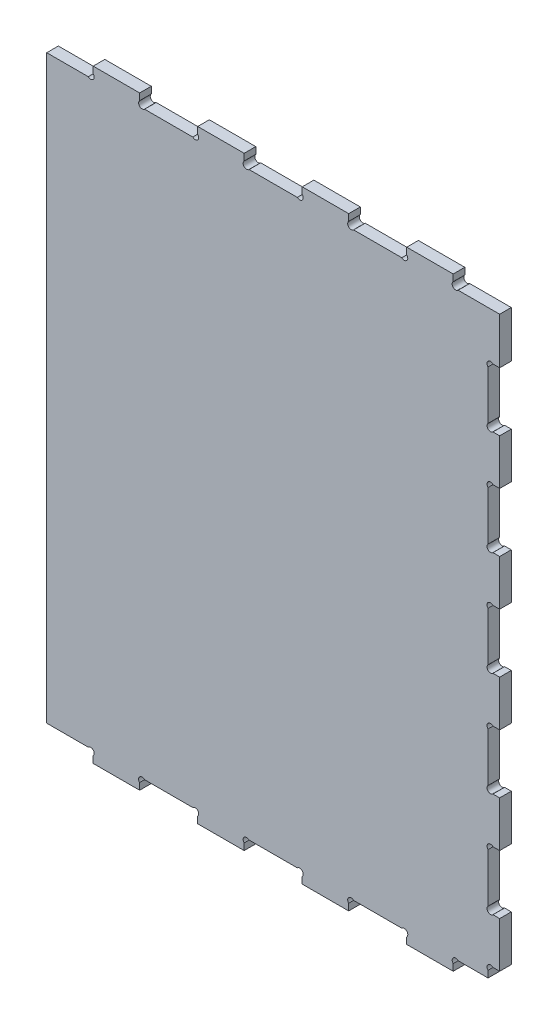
ISO-10303-21;
HEADER;
FILE_DESCRIPTION(('STEP AP214'),'2;1');
FILE_NAME('part.step','',(''),(''),'','','');
FILE_SCHEMA(('AUTOMOTIVE_DESIGN { 1 0 10303 214 1 1 1 1 }'));
ENDSEC;
DATA;
#1=APPLICATION_CONTEXT('core data for automotive mechanical design processes');
#2=APPLICATION_PROTOCOL_DEFINITION('international standard','automotive_design',2000,#1);
#3=PRODUCT_CONTEXT('',#1,'mechanical');
#4=PRODUCT('Part','Part','',(#3));
#5=PRODUCT_RELATED_PRODUCT_CATEGORY('part','',(#4));
#6=PRODUCT_DEFINITION_FORMATION('','',#4);
#7=PRODUCT_DEFINITION_CONTEXT('part definition',#1,'design');
#8=PRODUCT_DEFINITION('design','',#6,#7);
#9=PRODUCT_DEFINITION_SHAPE('','',#8);
#10=(LENGTH_UNIT() NAMED_UNIT(*) SI_UNIT(.MILLI.,.METRE.));
#11=(NAMED_UNIT(*) PLANE_ANGLE_UNIT() SI_UNIT($,.RADIAN.));
#12=(NAMED_UNIT(*) SI_UNIT($,.STERADIAN.) SOLID_ANGLE_UNIT());
#13=UNCERTAINTY_MEASURE_WITH_UNIT(LENGTH_MEASURE(1.E-05),#10,'distance_accuracy_value','');
#14=(GEOMETRIC_REPRESENTATION_CONTEXT(3) GLOBAL_UNCERTAINTY_ASSIGNED_CONTEXT((#13)) GLOBAL_UNIT_ASSIGNED_CONTEXT((#10,
#11,#12)) REPRESENTATION_CONTEXT('',''));
#15=CARTESIAN_POINT('',(0.,0.,0.));
#16=DIRECTION('',(0.,0.,1.));
#17=DIRECTION('',(1.,0.,0.));
#18=AXIS2_PLACEMENT_3D('',#15,#16,#17);
#19=CARTESIAN_POINT('',(0.,0.,-10.));
#20=DIRECTION('',(1.,0.,0.));
#21=DIRECTION('',(0.,0.,-1.));
#22=AXIS2_PLACEMENT_3D('',#19,#20,#21);
#23=PLANE('',#22);
#24=DIRECTION('',(0.,0.,1.));
#25=VECTOR('',#24,1.);
#26=CARTESIAN_POINT('',(0.,370.,-10.));
#27=LINE('',#26,#25);
#28=CARTESIAN_POINT('',(0.,370.,-10.));
#29=VERTEX_POINT('',#28);
#30=CARTESIAN_POINT('',(0.,370.,0.));
#31=VERTEX_POINT('',#30);
#32=EDGE_CURVE('E617',#29,#31,#27,.T.);
#33=ORIENTED_EDGE('',*,*,#32,.F.);
#34=DIRECTION('',(0.,1.,0.));
#35=VECTOR('',#34,1.);
#36=CARTESIAN_POINT('',(0.,0.,-10.));
#37=LINE('',#36,#35);
#38=CARTESIAN_POINT('',(0.,409.322324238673,-10.));
#39=VERTEX_POINT('',#38);
#40=EDGE_CURVE('E961',#29,#39,#37,.T.);
#41=ORIENTED_EDGE('',*,*,#40,.T.);
#42=DIRECTION('',(0.,0.,1.));
#43=VECTOR('',#42,1.);
#44=CARTESIAN_POINT('',(0.,409.322324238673,-10.));
#45=LINE('',#44,#43);
#46=CARTESIAN_POINT('',(0.,409.322324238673,0.));
#47=VERTEX_POINT('',#46);
#48=EDGE_CURVE('E638',#39,#47,#45,.T.);
#49=ORIENTED_EDGE('',*,*,#48,.T.);
#50=DIRECTION('',(0.,1.,0.));
#51=VECTOR('',#50,1.);
#52=CARTESIAN_POINT('',(0.,0.,0.));
#53=LINE('',#52,#51);
#54=EDGE_CURVE('E979',#31,#47,#53,.T.);
#55=ORIENTED_EDGE('',*,*,#54,.F.);
#56=EDGE_LOOP('',(#33,#41,#49,#55));
#57=FACE_BOUND('',#56,.T.);
#58=ADVANCED_FACE('F33',(#57),#23,.T.);
#59=DIRECTION('',(0.,0.,1.));
#60=VECTOR('',#59,1.);
#61=CARTESIAN_POINT('',(0.,319.322324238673,-10.));
#62=LINE('',#61,#60);
#63=CARTESIAN_POINT('',(0.,319.322324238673,-10.));
#64=VERTEX_POINT('',#63);
#65=CARTESIAN_POINT('',(0.,319.322324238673,0.));
#66=VERTEX_POINT('',#65);
#67=EDGE_CURVE('E1144',#64,#66,#62,.T.);
#68=ORIENTED_EDGE('',*,*,#67,.T.);
#69=CARTESIAN_POINT('',(0.,280.,0.));
#70=VERTEX_POINT('',#69);
#71=EDGE_CURVE('E1122',#70,#66,#53,.T.);
#72=ORIENTED_EDGE('',*,*,#71,.F.);
#73=DIRECTION('',(0.,0.,1.));
#74=VECTOR('',#73,1.);
#75=CARTESIAN_POINT('',(0.,280.,-10.));
#76=LINE('',#75,#74);
#77=CARTESIAN_POINT('',(0.,280.,-10.));
#78=VERTEX_POINT('',#77);
#79=EDGE_CURVE('E1141',#78,#70,#76,.T.);
#80=ORIENTED_EDGE('',*,*,#79,.F.);
#81=EDGE_CURVE('E1145',#78,#64,#37,.T.);
#82=ORIENTED_EDGE('',*,*,#81,.T.);
#83=EDGE_LOOP('',(#68,#72,#80,#82));
#84=FACE_BOUND('',#83,.T.);
#85=ADVANCED_FACE('F1139',(#84),#23,.T.);
#86=DIRECTION('',(0.,0.,1.));
#87=VECTOR('',#86,1.);
#88=CARTESIAN_POINT('',(0.,229.322324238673,-10.));
#89=LINE('',#88,#87);
#90=CARTESIAN_POINT('',(0.,229.322324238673,-10.));
#91=VERTEX_POINT('',#90);
#92=CARTESIAN_POINT('',(0.,229.322324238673,0.));
#93=VERTEX_POINT('',#92);
#94=EDGE_CURVE('E1164',#91,#93,#89,.T.);
#95=ORIENTED_EDGE('',*,*,#94,.T.);
#96=CARTESIAN_POINT('',(0.,190.,0.));
#97=VERTEX_POINT('',#96);
#98=EDGE_CURVE('E1120',#97,#93,#53,.T.);
#99=ORIENTED_EDGE('',*,*,#98,.F.);
#100=DIRECTION('',(0.,0.,1.));
#101=VECTOR('',#100,1.);
#102=CARTESIAN_POINT('',(0.,190.,-10.));
#103=LINE('',#102,#101);
#104=CARTESIAN_POINT('',(0.,190.,-10.));
#105=VERTEX_POINT('',#104);
#106=EDGE_CURVE('E1088',#105,#97,#103,.T.);
#107=ORIENTED_EDGE('',*,*,#106,.F.);
#108=EDGE_CURVE('E1083',#105,#91,#37,.T.);
#109=ORIENTED_EDGE('',*,*,#108,.T.);
#110=EDGE_LOOP('',(#95,#99,#107,#109));
#111=FACE_BOUND('',#110,.T.);
#112=ADVANCED_FACE('F1361',(#111),#23,.T.);
#113=DIRECTION('',(0.,0.,1.));
#114=VECTOR('',#113,1.);
#115=CARTESIAN_POINT('',(0.,139.322324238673,-10.));
#116=LINE('',#115,#114);
#117=CARTESIAN_POINT('',(0.,139.322324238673,-10.));
#118=VERTEX_POINT('',#117);
#119=CARTESIAN_POINT('',(0.,139.322324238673,0.));
#120=VERTEX_POINT('',#119);
#121=EDGE_CURVE('E1084',#118,#120,#116,.T.);
#122=ORIENTED_EDGE('',*,*,#121,.T.);
#123=CARTESIAN_POINT('',(0.,100.,0.));
#124=VERTEX_POINT('',#123);
#125=EDGE_CURVE('E978',#124,#120,#53,.T.);
#126=ORIENTED_EDGE('',*,*,#125,.F.);
#127=DIRECTION('',(0.,0.,1.));
#128=VECTOR('',#127,1.);
#129=CARTESIAN_POINT('',(0.,100.,-10.));
#130=LINE('',#129,#128);
#131=CARTESIAN_POINT('',(0.,100.,-10.));
#132=VERTEX_POINT('',#131);
#133=EDGE_CURVE('E605',#132,#124,#130,.T.);
#134=ORIENTED_EDGE('',*,*,#133,.F.);
#135=EDGE_CURVE('E960',#132,#118,#37,.T.);
#136=ORIENTED_EDGE('',*,*,#135,.T.);
#137=EDGE_LOOP('',(#122,#126,#134,#136));
#138=FACE_BOUND('',#137,.T.);
#139=ADVANCED_FACE('F1116',(#138),#23,.T.);
#140=DIRECTION('',(0.,0.,1.));
#141=VECTOR('',#140,1.);
#142=CARTESIAN_POINT('',(0.,460.,-10.));
#143=LINE('',#142,#141);
#144=CARTESIAN_POINT('',(0.,460.,-10.));
#145=VERTEX_POINT('',#144);
#146=CARTESIAN_POINT('',(0.,460.,0.));
#147=VERTEX_POINT('',#146);
#148=EDGE_CURVE('E646',#145,#147,#143,.T.);
#149=ORIENTED_EDGE('',*,*,#148,.F.);
#150=CARTESIAN_POINT('',(0.,500.,-10.));
#151=VERTEX_POINT('',#150);
#152=EDGE_CURVE('E954',#145,#151,#37,.T.);
#153=ORIENTED_EDGE('',*,*,#152,.T.);
#154=DIRECTION('',(0.,0.,1.));
#155=VECTOR('',#154,1.);
#156=CARTESIAN_POINT('',(0.,500.,-10.));
#157=LINE('',#156,#155);
#158=CARTESIAN_POINT('',(0.,500.,0.));
#159=VERTEX_POINT('',#158);
#160=EDGE_CURVE('E970',#151,#159,#157,.T.);
#161=ORIENTED_EDGE('',*,*,#160,.T.);
#162=EDGE_CURVE('E974',#147,#159,#53,.T.);
#163=ORIENTED_EDGE('',*,*,#162,.F.);
#164=EDGE_LOOP('',(#149,#153,#161,#163));
#165=FACE_BOUND('',#164,.T.);
#166=ADVANCED_FACE('F1234',(#165),#23,.T.);
#167=CARTESIAN_POINT('',(0.,0.,-10.));
#168=DIRECTION('',(0.,-1.,0.));
#169=DIRECTION('',(0.,0.,-1.));
#170=AXIS2_PLACEMENT_3D('',#167,#168,#169);
#171=PLANE('',#170);
#172=DIRECTION('',(1.,0.,0.));
#173=VECTOR('',#172,1.);
#174=CARTESIAN_POINT('',(0.,0.,-10.));
#175=LINE('',#174,#173);
#176=CARTESIAN_POINT('',(-390.,0.,-10.));
#177=VERTEX_POINT('',#176);
#178=CARTESIAN_POINT('',(-354.242640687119,0.,-10.));
#179=VERTEX_POINT('',#178);
#180=EDGE_CURVE('E951',#177,#179,#175,.T.);
#181=ORIENTED_EDGE('',*,*,#180,.T.);
#182=DIRECTION('',(0.,0.,1.));
#183=VECTOR('',#182,1.);
#184=CARTESIAN_POINT('',(-354.242640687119,0.,-10.));
#185=LINE('',#184,#183);
#186=CARTESIAN_POINT('',(-354.242640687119,0.,0.));
#187=VERTEX_POINT('',#186);
#188=EDGE_CURVE('E671',#179,#187,#185,.T.);
#189=ORIENTED_EDGE('',*,*,#188,.T.);
#190=DIRECTION('',(1.,0.,0.));
#191=VECTOR('',#190,1.);
#192=CARTESIAN_POINT('',(0.,0.,0.));
#193=LINE('',#192,#191);
#194=CARTESIAN_POINT('',(-390.,0.,0.));
#195=VERTEX_POINT('',#194);
#196=EDGE_CURVE('E971',#195,#187,#193,.T.);
#197=ORIENTED_EDGE('',*,*,#196,.F.);
#198=DIRECTION('',(0.,0.,1.));
#199=VECTOR('',#198,1.);
#200=CARTESIAN_POINT('',(-390.,0.,-10.));
#201=LINE('',#200,#199);
#202=EDGE_CURVE('E987',#177,#195,#201,.T.);
#203=ORIENTED_EDGE('',*,*,#202,.F.);
#204=EDGE_LOOP('',(#181,#189,#197,#203));
#205=FACE_BOUND('',#204,.T.);
#206=ADVANCED_FACE('F35',(#205),#171,.T.);
#207=CARTESIAN_POINT('',(-305.757359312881,0.,-10.));
#208=VERTEX_POINT('',#207);
#209=CARTESIAN_POINT('',(-264.242640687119,0.,-10.));
#210=VERTEX_POINT('',#209);
#211=EDGE_CURVE('E955',#208,#210,#175,.T.);
#212=ORIENTED_EDGE('',*,*,#211,.T.);
#213=DIRECTION('',(0.,0.,1.));
#214=VECTOR('',#213,1.);
#215=CARTESIAN_POINT('',(-264.242640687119,0.,-10.));
#216=LINE('',#215,#214);
#217=CARTESIAN_POINT('',(-264.242640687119,0.,0.));
#218=VERTEX_POINT('',#217);
#219=EDGE_CURVE('E681',#210,#218,#216,.T.);
#220=ORIENTED_EDGE('',*,*,#219,.T.);
#221=CARTESIAN_POINT('',(-305.757359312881,0.,0.));
#222=VERTEX_POINT('',#221);
#223=EDGE_CURVE('E975',#222,#218,#193,.T.);
#224=ORIENTED_EDGE('',*,*,#223,.F.);
#225=DIRECTION('',(0.,0.,1.));
#226=VECTOR('',#225,1.);
#227=CARTESIAN_POINT('',(-305.757359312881,0.,-10.));
#228=LINE('',#227,#226);
#229=EDGE_CURVE('E668',#222,#208,#228,.F.);
#230=ORIENTED_EDGE('',*,*,#229,.T.);
#231=EDGE_LOOP('',(#212,#220,#224,#230));
#232=FACE_BOUND('',#231,.T.);
#233=ADVANCED_FACE('F1376',(#232),#171,.T.);
#234=CARTESIAN_POINT('',(-215.757359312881,0.,-10.));
#235=VERTEX_POINT('',#234);
#236=CARTESIAN_POINT('',(-174.242640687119,0.,-10.));
#237=VERTEX_POINT('',#236);
#238=EDGE_CURVE('E1877',#235,#237,#175,.T.);
#239=ORIENTED_EDGE('',*,*,#238,.T.);
#240=DIRECTION('',(0.,0.,1.));
#241=VECTOR('',#240,1.);
#242=CARTESIAN_POINT('',(-174.242640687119,0.,-10.));
#243=LINE('',#242,#241);
#244=CARTESIAN_POINT('',(-174.242640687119,0.,0.));
#245=VERTEX_POINT('',#244);
#246=EDGE_CURVE('E691',#237,#245,#243,.T.);
#247=ORIENTED_EDGE('',*,*,#246,.T.);
#248=CARTESIAN_POINT('',(-215.757359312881,0.,0.));
#249=VERTEX_POINT('',#248);
#250=EDGE_CURVE('E1852',#249,#245,#193,.T.);
#251=ORIENTED_EDGE('',*,*,#250,.F.);
#252=DIRECTION('',(0.,0.,1.));
#253=VECTOR('',#252,1.);
#254=CARTESIAN_POINT('',(-215.757359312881,0.,-10.));
#255=LINE('',#254,#253);
#256=EDGE_CURVE('E678',#249,#235,#255,.F.);
#257=ORIENTED_EDGE('',*,*,#256,.T.);
#258=EDGE_LOOP('',(#239,#247,#251,#257));
#259=FACE_BOUND('',#258,.T.);
#260=ADVANCED_FACE('F1876',(#259),#171,.T.);
#261=CARTESIAN_POINT('',(-125.757359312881,0.,-10.));
#262=VERTEX_POINT('',#261);
#263=CARTESIAN_POINT('',(-84.2426406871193,0.,-10.));
#264=VERTEX_POINT('',#263);
#265=EDGE_CURVE('E1879',#262,#264,#175,.T.);
#266=ORIENTED_EDGE('',*,*,#265,.T.);
#267=DIRECTION('',(0.,0.,1.));
#268=VECTOR('',#267,1.);
#269=CARTESIAN_POINT('',(-84.2426406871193,0.,-10.));
#270=LINE('',#269,#268);
#271=CARTESIAN_POINT('',(-84.2426406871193,0.,0.));
#272=VERTEX_POINT('',#271);
#273=EDGE_CURVE('E701',#264,#272,#270,.T.);
#274=ORIENTED_EDGE('',*,*,#273,.T.);
#275=CARTESIAN_POINT('',(-125.757359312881,0.,0.));
#276=VERTEX_POINT('',#275);
#277=EDGE_CURVE('E1850',#276,#272,#193,.T.);
#278=ORIENTED_EDGE('',*,*,#277,.F.);
#279=DIRECTION('',(0.,0.,1.));
#280=VECTOR('',#279,1.);
#281=CARTESIAN_POINT('',(-125.757359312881,0.,-10.));
#282=LINE('',#281,#280);
#283=EDGE_CURVE('E688',#276,#262,#282,.F.);
#284=ORIENTED_EDGE('',*,*,#283,.T.);
#285=EDGE_LOOP('',(#266,#274,#278,#284));
#286=FACE_BOUND('',#285,.T.);
#287=ADVANCED_FACE('F1771',(#286),#171,.T.);
#288=DIRECTION('',(0.,0.,-1.));
#289=VECTOR('',#288,1.);
#290=CARTESIAN_POINT('',(-10.,0.,0.));
#291=LINE('',#290,#289);
#292=CARTESIAN_POINT('',(-10.,0.,0.));
#293=VERTEX_POINT('',#292);
#294=CARTESIAN_POINT('',(-10.,0.,-10.));
#295=VERTEX_POINT('',#294);
#296=EDGE_CURVE('E1841',#293,#295,#291,.T.);
#297=ORIENTED_EDGE('',*,*,#296,.F.);
#298=CARTESIAN_POINT('',(-35.7573593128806,0.,0.));
#299=VERTEX_POINT('',#298);
#300=EDGE_CURVE('E950',#299,#293,#193,.T.);
#301=ORIENTED_EDGE('',*,*,#300,.F.);
#302=DIRECTION('',(0.,0.,1.));
#303=VECTOR('',#302,1.);
#304=CARTESIAN_POINT('',(-35.7573593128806,0.,-10.));
#305=LINE('',#304,#303);
#306=CARTESIAN_POINT('',(-35.7573593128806,0.,-10.));
#307=VERTEX_POINT('',#306);
#308=EDGE_CURVE('E698',#299,#307,#305,.F.);
#309=ORIENTED_EDGE('',*,*,#308,.T.);
#310=EDGE_CURVE('E956',#307,#295,#175,.T.);
#311=ORIENTED_EDGE('',*,*,#310,.T.);
#312=EDGE_LOOP('',(#297,#301,#309,#311));
#313=FACE_BOUND('',#312,.T.);
#314=ADVANCED_FACE('F1378',(#313),#171,.T.);
#315=CARTESIAN_POINT('',(-79.9999999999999,-10.,0.));
#316=DIRECTION('',(-1.,0.,0.));
#317=DIRECTION('',(0.,0.,1.));
#318=AXIS2_PLACEMENT_3D('',#315,#316,#317);
#319=PLANE('',#318);
#320=DIRECTION('',(0.,1.,0.));
#321=VECTOR('',#320,1.);
#322=CARTESIAN_POINT('',(-79.9999999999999,-10.,0.));
#323=LINE('',#322,#321);
#324=CARTESIAN_POINT('',(-79.9999999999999,-10.,0.));
#325=VERTEX_POINT('',#324);
#326=CARTESIAN_POINT('',(-79.9999999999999,-4.24264068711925,0.));
#327=VERTEX_POINT('',#326);
#328=EDGE_CURVE('E790',#325,#327,#323,.T.);
#329=ORIENTED_EDGE('',*,*,#328,.T.);
#330=DIRECTION('',(0.,0.,1.));
#331=VECTOR('',#330,1.);
#332=CARTESIAN_POINT('',(-79.9999999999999,-4.24264068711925,-10.));
#333=LINE('',#332,#331);
#334=CARTESIAN_POINT('',(-79.9999999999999,-4.24264068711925,-10.));
#335=VERTEX_POINT('',#334);
#336=EDGE_CURVE('E1039',#327,#335,#333,.F.);
#337=ORIENTED_EDGE('',*,*,#336,.T.);
#338=DIRECTION('',(0.,1.,0.));
#339=VECTOR('',#338,1.);
#340=CARTESIAN_POINT('',(-79.9999999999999,-10.,-10.));
#341=LINE('',#340,#339);
#342=CARTESIAN_POINT('',(-79.9999999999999,-10.,-10.));
#343=VERTEX_POINT('',#342);
#344=EDGE_CURVE('E799',#343,#335,#341,.T.);
#345=ORIENTED_EDGE('',*,*,#344,.F.);
#346=DIRECTION('',(0.,0.,1.));
#347=VECTOR('',#346,1.);
#348=CARTESIAN_POINT('',(-79.9999999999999,-10.,0.));
#349=LINE('',#348,#347);
#350=EDGE_CURVE('E778',#343,#325,#349,.T.);
#351=ORIENTED_EDGE('',*,*,#350,.T.);
#352=EDGE_LOOP('',(#329,#337,#345,#351));
#353=FACE_BOUND('',#352,.T.);
#354=ADVANCED_FACE('F1546',(#353),#319,.T.);
#355=CARTESIAN_POINT('',(-39.9999999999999,-10.,0.));
#356=DIRECTION('',(1.,0.,0.));
#357=DIRECTION('',(0.,0.,-1.));
#358=AXIS2_PLACEMENT_3D('',#355,#356,#357);
#359=PLANE('',#358);
#360=DIRECTION('',(0.,1.,0.));
#361=VECTOR('',#360,1.);
#362=CARTESIAN_POINT('',(-39.9999999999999,-10.,-10.));
#363=LINE('',#362,#361);
#364=CARTESIAN_POINT('',(-39.9999999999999,-10.,-10.));
#365=VERTEX_POINT('',#364);
#366=CARTESIAN_POINT('',(-39.9999999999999,-4.24264068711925,-10.));
#367=VERTEX_POINT('',#366);
#368=EDGE_CURVE('E796',#365,#367,#363,.T.);
#369=ORIENTED_EDGE('',*,*,#368,.T.);
#370=DIRECTION('',(0.,0.,1.));
#371=VECTOR('',#370,1.);
#372=CARTESIAN_POINT('',(-39.9999999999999,-4.24264068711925,-10.));
#373=LINE('',#372,#371);
#374=CARTESIAN_POINT('',(-39.9999999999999,-4.24264068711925,0.));
#375=VERTEX_POINT('',#374);
#376=EDGE_CURVE('E1036',#367,#375,#373,.T.);
#377=ORIENTED_EDGE('',*,*,#376,.T.);
#378=DIRECTION('',(0.,1.,0.));
#379=VECTOR('',#378,1.);
#380=CARTESIAN_POINT('',(-39.9999999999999,-10.,0.));
#381=LINE('',#380,#379);
#382=CARTESIAN_POINT('',(-39.9999999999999,-10.,0.));
#383=VERTEX_POINT('',#382);
#384=EDGE_CURVE('E793',#383,#375,#381,.T.);
#385=ORIENTED_EDGE('',*,*,#384,.F.);
#386=DIRECTION('',(0.,0.,-1.));
#387=VECTOR('',#386,1.);
#388=CARTESIAN_POINT('',(-39.9999999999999,-10.,0.));
#389=LINE('',#388,#387);
#390=EDGE_CURVE('E784',#383,#365,#389,.T.);
#391=ORIENTED_EDGE('',*,*,#390,.T.);
#392=EDGE_LOOP('',(#369,#377,#385,#391));
#393=FACE_BOUND('',#392,.T.);
#394=ADVANCED_FACE('F1539',(#393),#359,.T.);
#395=CARTESIAN_POINT('',(-170.,-10.,0.));
#396=DIRECTION('',(-1.,0.,0.));
#397=DIRECTION('',(0.,0.,1.));
#398=AXIS2_PLACEMENT_3D('',#395,#396,#397);
#399=PLANE('',#398);
#400=DIRECTION('',(0.,1.,0.));
#401=VECTOR('',#400,1.);
#402=CARTESIAN_POINT('',(-170.,-10.,0.));
#403=LINE('',#402,#401);
#404=CARTESIAN_POINT('',(-170.,-10.,0.));
#405=VERTEX_POINT('',#404);
#406=CARTESIAN_POINT('',(-170.,-4.24264068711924,0.));
#407=VERTEX_POINT('',#406);
#408=EDGE_CURVE('E766',#405,#407,#403,.T.);
#409=ORIENTED_EDGE('',*,*,#408,.T.);
#410=DIRECTION('',(0.,0.,1.));
#411=VECTOR('',#410,1.);
#412=CARTESIAN_POINT('',(-170.,-4.24264068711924,-10.));
#413=LINE('',#412,#411);
#414=CARTESIAN_POINT('',(-170.,-4.24264068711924,-10.));
#415=VERTEX_POINT('',#414);
#416=EDGE_CURVE('E1033',#407,#415,#413,.F.);
#417=ORIENTED_EDGE('',*,*,#416,.T.);
#418=DIRECTION('',(0.,1.,0.));
#419=VECTOR('',#418,1.);
#420=CARTESIAN_POINT('',(-170.,-10.,-10.));
#421=LINE('',#420,#419);
#422=CARTESIAN_POINT('',(-170.,-10.,-10.));
#423=VERTEX_POINT('',#422);
#424=EDGE_CURVE('E775',#423,#415,#421,.T.);
#425=ORIENTED_EDGE('',*,*,#424,.F.);
#426=DIRECTION('',(0.,0.,1.));
#427=VECTOR('',#426,1.);
#428=CARTESIAN_POINT('',(-170.,-10.,0.));
#429=LINE('',#428,#427);
#430=EDGE_CURVE('E754',#423,#405,#429,.T.);
#431=ORIENTED_EDGE('',*,*,#430,.T.);
#432=EDGE_LOOP('',(#409,#417,#425,#431));
#433=FACE_BOUND('',#432,.T.);
#434=ADVANCED_FACE('F1535',(#433),#399,.T.);
#435=CARTESIAN_POINT('',(-130.,-10.,0.));
#436=DIRECTION('',(1.,0.,0.));
#437=DIRECTION('',(0.,0.,-1.));
#438=AXIS2_PLACEMENT_3D('',#435,#436,#437);
#439=PLANE('',#438);
#440=DIRECTION('',(0.,1.,0.));
#441=VECTOR('',#440,1.);
#442=CARTESIAN_POINT('',(-130.,-10.,-10.));
#443=LINE('',#442,#441);
#444=CARTESIAN_POINT('',(-130.,-10.,-10.));
#445=VERTEX_POINT('',#444);
#446=CARTESIAN_POINT('',(-130.,-4.24264068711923,-10.));
#447=VERTEX_POINT('',#446);
#448=EDGE_CURVE('E772',#445,#447,#443,.T.);
#449=ORIENTED_EDGE('',*,*,#448,.T.);
#450=DIRECTION('',(0.,0.,1.));
#451=VECTOR('',#450,1.);
#452=CARTESIAN_POINT('',(-130.,-4.24264068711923,-10.));
#453=LINE('',#452,#451);
#454=CARTESIAN_POINT('',(-130.,-4.24264068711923,0.));
#455=VERTEX_POINT('',#454);
#456=EDGE_CURVE('E1030',#447,#455,#453,.T.);
#457=ORIENTED_EDGE('',*,*,#456,.T.);
#458=DIRECTION('',(0.,1.,0.));
#459=VECTOR('',#458,1.);
#460=CARTESIAN_POINT('',(-130.,-10.,0.));
#461=LINE('',#460,#459);
#462=CARTESIAN_POINT('',(-130.,-10.,0.));
#463=VERTEX_POINT('',#462);
#464=EDGE_CURVE('E769',#463,#455,#461,.T.);
#465=ORIENTED_EDGE('',*,*,#464,.F.);
#466=DIRECTION('',(0.,0.,-1.));
#467=VECTOR('',#466,1.);
#468=CARTESIAN_POINT('',(-130.,-10.,0.));
#469=LINE('',#468,#467);
#470=EDGE_CURVE('E760',#463,#445,#469,.T.);
#471=ORIENTED_EDGE('',*,*,#470,.T.);
#472=EDGE_LOOP('',(#449,#457,#465,#471));
#473=FACE_BOUND('',#472,.T.);
#474=ADVANCED_FACE('F1527',(#473),#439,.T.);
#475=CARTESIAN_POINT('',(-260.,-10.,0.));
#476=DIRECTION('',(-1.,0.,0.));
#477=DIRECTION('',(0.,0.,1.));
#478=AXIS2_PLACEMENT_3D('',#475,#476,#477);
#479=PLANE('',#478);
#480=DIRECTION('',(0.,1.,0.));
#481=VECTOR('',#480,1.);
#482=CARTESIAN_POINT('',(-260.,-10.,0.));
#483=LINE('',#482,#481);
#484=CARTESIAN_POINT('',(-260.,-10.,0.));
#485=VERTEX_POINT('',#484);
#486=CARTESIAN_POINT('',(-260.,-4.24264068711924,0.));
#487=VERTEX_POINT('',#486);
#488=EDGE_CURVE('E742',#485,#487,#483,.T.);
#489=ORIENTED_EDGE('',*,*,#488,.T.);
#490=DIRECTION('',(0.,0.,1.));
#491=VECTOR('',#490,1.);
#492=CARTESIAN_POINT('',(-260.,-4.24264068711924,-10.));
#493=LINE('',#492,#491);
#494=CARTESIAN_POINT('',(-260.,-4.24264068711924,-10.));
#495=VERTEX_POINT('',#494);
#496=EDGE_CURVE('E1027',#487,#495,#493,.F.);
#497=ORIENTED_EDGE('',*,*,#496,.T.);
#498=DIRECTION('',(0.,1.,0.));
#499=VECTOR('',#498,1.);
#500=CARTESIAN_POINT('',(-260.,-10.,-10.));
#501=LINE('',#500,#499);
#502=CARTESIAN_POINT('',(-260.,-10.,-10.));
#503=VERTEX_POINT('',#502);
#504=EDGE_CURVE('E751',#503,#495,#501,.T.);
#505=ORIENTED_EDGE('',*,*,#504,.F.);
#506=DIRECTION('',(0.,0.,1.));
#507=VECTOR('',#506,1.);
#508=CARTESIAN_POINT('',(-260.,-10.,0.));
#509=LINE('',#508,#507);
#510=EDGE_CURVE('E730',#503,#485,#509,.T.);
#511=ORIENTED_EDGE('',*,*,#510,.T.);
#512=EDGE_LOOP('',(#489,#497,#505,#511));
#513=FACE_BOUND('',#512,.T.);
#514=ADVANCED_FACE('F1523',(#513),#479,.T.);
#515=CARTESIAN_POINT('',(-220.,-10.,0.));
#516=DIRECTION('',(1.,0.,0.));
#517=DIRECTION('',(0.,0.,-1.));
#518=AXIS2_PLACEMENT_3D('',#515,#516,#517);
#519=PLANE('',#518);
#520=DIRECTION('',(0.,1.,0.));
#521=VECTOR('',#520,1.);
#522=CARTESIAN_POINT('',(-220.,-10.,-10.));
#523=LINE('',#522,#521);
#524=CARTESIAN_POINT('',(-220.,-10.,-10.));
#525=VERTEX_POINT('',#524);
#526=CARTESIAN_POINT('',(-220.,-4.24264068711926,-10.));
#527=VERTEX_POINT('',#526);
#528=EDGE_CURVE('E748',#525,#527,#523,.T.);
#529=ORIENTED_EDGE('',*,*,#528,.T.);
#530=DIRECTION('',(0.,0.,1.));
#531=VECTOR('',#530,1.);
#532=CARTESIAN_POINT('',(-220.,-4.24264068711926,-10.));
#533=LINE('',#532,#531);
#534=CARTESIAN_POINT('',(-220.,-4.24264068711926,0.));
#535=VERTEX_POINT('',#534);
#536=EDGE_CURVE('E1024',#527,#535,#533,.T.);
#537=ORIENTED_EDGE('',*,*,#536,.T.);
#538=DIRECTION('',(0.,1.,0.));
#539=VECTOR('',#538,1.);
#540=CARTESIAN_POINT('',(-220.,-10.,0.));
#541=LINE('',#540,#539);
#542=CARTESIAN_POINT('',(-220.,-10.,0.));
#543=VERTEX_POINT('',#542);
#544=EDGE_CURVE('E745',#543,#535,#541,.T.);
#545=ORIENTED_EDGE('',*,*,#544,.F.);
#546=DIRECTION('',(0.,0.,-1.));
#547=VECTOR('',#546,1.);
#548=CARTESIAN_POINT('',(-220.,-10.,0.));
#549=LINE('',#548,#547);
#550=EDGE_CURVE('E736',#543,#525,#549,.T.);
#551=ORIENTED_EDGE('',*,*,#550,.T.);
#552=EDGE_LOOP('',(#529,#537,#545,#551));
#553=FACE_BOUND('',#552,.T.);
#554=ADVANCED_FACE('F1515',(#553),#519,.T.);
#555=CARTESIAN_POINT('',(-350.,-10.0000000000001,0.));
#556=DIRECTION('',(-1.,0.,0.));
#557=DIRECTION('',(0.,0.,1.));
#558=AXIS2_PLACEMENT_3D('',#555,#556,#557);
#559=PLANE('',#558);
#560=DIRECTION('',(0.,1.,0.));
#561=VECTOR('',#560,1.);
#562=CARTESIAN_POINT('',(-350.,-10.0000000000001,0.));
#563=LINE('',#562,#561);
#564=CARTESIAN_POINT('',(-350.,-10.0000000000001,0.));
#565=VERTEX_POINT('',#564);
#566=CARTESIAN_POINT('',(-350.,-4.24264068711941,0.));
#567=VERTEX_POINT('',#566);
#568=EDGE_CURVE('E718',#565,#567,#563,.T.);
#569=ORIENTED_EDGE('',*,*,#568,.T.);
#570=DIRECTION('',(0.,0.,1.));
#571=VECTOR('',#570,1.);
#572=CARTESIAN_POINT('',(-350.,-4.24264068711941,-10.));
#573=LINE('',#572,#571);
#574=CARTESIAN_POINT('',(-350.,-4.24264068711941,-10.));
#575=VERTEX_POINT('',#574);
#576=EDGE_CURVE('E1021',#567,#575,#573,.F.);
#577=ORIENTED_EDGE('',*,*,#576,.T.);
#578=DIRECTION('',(0.,1.,0.));
#579=VECTOR('',#578,1.);
#580=CARTESIAN_POINT('',(-350.,-10.0000000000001,-10.));
#581=LINE('',#580,#579);
#582=CARTESIAN_POINT('',(-350.,-10.0000000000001,-10.));
#583=VERTEX_POINT('',#582);
#584=EDGE_CURVE('E727',#583,#575,#581,.T.);
#585=ORIENTED_EDGE('',*,*,#584,.F.);
#586=DIRECTION('',(0.,0.,1.));
#587=VECTOR('',#586,1.);
#588=CARTESIAN_POINT('',(-350.,-10.0000000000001,0.));
#589=LINE('',#588,#587);
#590=EDGE_CURVE('E704',#583,#565,#589,.T.);
#591=ORIENTED_EDGE('',*,*,#590,.T.);
#592=EDGE_LOOP('',(#569,#577,#585,#591));
#593=FACE_BOUND('',#592,.T.);
#594=ADVANCED_FACE('F1511',(#593),#559,.T.);
#595=CARTESIAN_POINT('',(-310.,-10.0000000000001,0.));
#596=DIRECTION('',(1.,0.,0.));
#597=DIRECTION('',(0.,0.,-1.));
#598=AXIS2_PLACEMENT_3D('',#595,#596,#597);
#599=PLANE('',#598);
#600=DIRECTION('',(0.,1.,0.));
#601=VECTOR('',#600,1.);
#602=CARTESIAN_POINT('',(-310.,-10.0000000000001,-10.));
#603=LINE('',#602,#601);
#604=CARTESIAN_POINT('',(-310.,-10.0000000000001,-10.));
#605=VERTEX_POINT('',#604);
#606=CARTESIAN_POINT('',(-310.,-4.24264068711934,-10.));
#607=VERTEX_POINT('',#606);
#608=EDGE_CURVE('E724',#605,#607,#603,.T.);
#609=ORIENTED_EDGE('',*,*,#608,.T.);
#610=DIRECTION('',(0.,0.,1.));
#611=VECTOR('',#610,1.);
#612=CARTESIAN_POINT('',(-310.,-4.24264068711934,-10.));
#613=LINE('',#612,#611);
#614=CARTESIAN_POINT('',(-310.,-4.24264068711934,0.));
#615=VERTEX_POINT('',#614);
#616=EDGE_CURVE('E1018',#607,#615,#613,.T.);
#617=ORIENTED_EDGE('',*,*,#616,.T.);
#618=DIRECTION('',(0.,1.,0.));
#619=VECTOR('',#618,1.);
#620=CARTESIAN_POINT('',(-310.,-10.0000000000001,0.));
#621=LINE('',#620,#619);
#622=CARTESIAN_POINT('',(-310.,-10.0000000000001,0.));
#623=VERTEX_POINT('',#622);
#624=EDGE_CURVE('E721',#623,#615,#621,.T.);
#625=ORIENTED_EDGE('',*,*,#624,.F.);
#626=DIRECTION('',(0.,0.,-1.));
#627=VECTOR('',#626,1.);
#628=CARTESIAN_POINT('',(-310.,-10.0000000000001,0.));
#629=LINE('',#628,#627);
#630=EDGE_CURVE('E712',#623,#605,#629,.T.);
#631=ORIENTED_EDGE('',*,*,#630,.T.);
#632=EDGE_LOOP('',(#609,#617,#625,#631));
#633=FACE_BOUND('',#632,.T.);
#634=ADVANCED_FACE('F1508',(#633),#599,.T.);
#635=CARTESIAN_POINT('',(0.,500.,-10.));
#636=DIRECTION('',(0.,1.,0.));
#637=DIRECTION('',(-1.,0.,0.));
#638=AXIS2_PLACEMENT_3D('',#635,#636,#637);
#639=PLANE('',#638);
#640=DIRECTION('',(0.,0.,1.));
#641=VECTOR('',#640,1.);
#642=CARTESIAN_POINT('',(-354.242640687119,500.,-10.));
#643=LINE('',#642,#641);
#644=CARTESIAN_POINT('',(-354.242640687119,500.,-10.));
#645=VERTEX_POINT('',#644);
#646=CARTESIAN_POINT('',(-354.242640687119,500.,0.));
#647=VERTEX_POINT('',#646);
#648=EDGE_CURVE('E823',#645,#647,#643,.T.);
#649=ORIENTED_EDGE('',*,*,#648,.F.);
#650=DIRECTION('',(-1.,0.,0.));
#651=VECTOR('',#650,1.);
#652=CARTESIAN_POINT('',(0.,500.,-10.));
#653=LINE('',#652,#651);
#654=CARTESIAN_POINT('',(-390.,500.,-10.));
#655=VERTEX_POINT('',#654);
#656=EDGE_CURVE('E959',#645,#655,#653,.T.);
#657=ORIENTED_EDGE('',*,*,#656,.T.);
#658=DIRECTION('',(0.,0.,1.));
#659=VECTOR('',#658,1.);
#660=CARTESIAN_POINT('',(-390.,500.,-10.));
#661=LINE('',#660,#659);
#662=CARTESIAN_POINT('',(-390.,500.,0.));
#663=VERTEX_POINT('',#662);
#664=EDGE_CURVE('E990',#655,#663,#661,.T.);
#665=ORIENTED_EDGE('',*,*,#664,.T.);
#666=DIRECTION('',(-1.,0.,0.));
#667=VECTOR('',#666,1.);
#668=CARTESIAN_POINT('',(0.,500.,0.));
#669=LINE('',#668,#667);
#670=EDGE_CURVE('E977',#647,#663,#669,.T.);
#671=ORIENTED_EDGE('',*,*,#670,.F.);
#672=EDGE_LOOP('',(#649,#657,#665,#671));
#673=FACE_BOUND('',#672,.T.);
#674=ADVANCED_FACE('F1303',(#673),#639,.T.);
#675=DIRECTION('',(0.,0.,1.));
#676=VECTOR('',#675,1.);
#677=CARTESIAN_POINT('',(-264.242640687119,500.,-10.));
#678=LINE('',#677,#676);
#679=CARTESIAN_POINT('',(-264.242640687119,500.,-10.));
#680=VERTEX_POINT('',#679);
#681=CARTESIAN_POINT('',(-264.242640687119,500.,0.));
#682=VERTEX_POINT('',#681);
#683=EDGE_CURVE('E834',#680,#682,#678,.T.);
#684=ORIENTED_EDGE('',*,*,#683,.F.);
#685=CARTESIAN_POINT('',(-305.757359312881,500.,-10.));
#686=VERTEX_POINT('',#685);
#687=EDGE_CURVE('E1263',#680,#686,#653,.T.);
#688=ORIENTED_EDGE('',*,*,#687,.T.);
#689=DIRECTION('',(0.,0.,1.));
#690=VECTOR('',#689,1.);
#691=CARTESIAN_POINT('',(-305.757359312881,500.,-10.));
#692=LINE('',#691,#690);
#693=CARTESIAN_POINT('',(-305.757359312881,500.,0.));
#694=VERTEX_POINT('',#693);
#695=EDGE_CURVE('E820',#694,#686,#692,.F.);
#696=ORIENTED_EDGE('',*,*,#695,.F.);
#697=EDGE_CURVE('E1283',#682,#694,#669,.T.);
#698=ORIENTED_EDGE('',*,*,#697,.F.);
#699=EDGE_LOOP('',(#684,#688,#696,#698));
#700=FACE_BOUND('',#699,.T.);
#701=ADVANCED_FACE('F1273',(#700),#639,.T.);
#702=DIRECTION('',(0.,0.,1.));
#703=VECTOR('',#702,1.);
#704=CARTESIAN_POINT('',(-174.242640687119,500.,-10.));
#705=LINE('',#704,#703);
#706=CARTESIAN_POINT('',(-174.242640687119,500.,-10.));
#707=VERTEX_POINT('',#706);
#708=CARTESIAN_POINT('',(-174.242640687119,500.,0.));
#709=VERTEX_POINT('',#708);
#710=EDGE_CURVE('E845',#707,#709,#705,.T.);
#711=ORIENTED_EDGE('',*,*,#710,.F.);
#712=CARTESIAN_POINT('',(-215.757359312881,500.,-10.));
#713=VERTEX_POINT('',#712);
#714=EDGE_CURVE('E967',#707,#713,#653,.T.);
#715=ORIENTED_EDGE('',*,*,#714,.T.);
#716=DIRECTION('',(0.,0.,1.));
#717=VECTOR('',#716,1.);
#718=CARTESIAN_POINT('',(-215.757359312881,500.,-10.));
#719=LINE('',#718,#717);
#720=CARTESIAN_POINT('',(-215.757359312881,500.,0.));
#721=VERTEX_POINT('',#720);
#722=EDGE_CURVE('E831',#721,#713,#719,.F.);
#723=ORIENTED_EDGE('',*,*,#722,.F.);
#724=EDGE_CURVE('E1304',#709,#721,#669,.T.);
#725=ORIENTED_EDGE('',*,*,#724,.F.);
#726=EDGE_LOOP('',(#711,#715,#723,#725));
#727=FACE_BOUND('',#726,.T.);
#728=ADVANCED_FACE('F1330',(#727),#639,.T.);
#729=DIRECTION('',(0.,0.,1.));
#730=VECTOR('',#729,1.);
#731=CARTESIAN_POINT('',(-125.757359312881,500.,-10.));
#732=LINE('',#731,#730);
#733=CARTESIAN_POINT('',(-125.757359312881,500.,0.));
#734=VERTEX_POINT('',#733);
#735=CARTESIAN_POINT('',(-125.757359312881,500.,-10.));
#736=VERTEX_POINT('',#735);
#737=EDGE_CURVE('E842',#734,#736,#732,.F.);
#738=ORIENTED_EDGE('',*,*,#737,.F.);
#739=CARTESIAN_POINT('',(-84.2426406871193,500.,0.));
#740=VERTEX_POINT('',#739);
#741=EDGE_CURVE('E984',#740,#734,#669,.T.);
#742=ORIENTED_EDGE('',*,*,#741,.F.);
#743=DIRECTION('',(0.,0.,1.));
#744=VECTOR('',#743,1.);
#745=CARTESIAN_POINT('',(-84.2426406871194,500.,-10.));
#746=LINE('',#745,#744);
#747=CARTESIAN_POINT('',(-84.2426406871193,500.,-10.));
#748=VERTEX_POINT('',#747);
#749=EDGE_CURVE('E924',#748,#740,#746,.T.);
#750=ORIENTED_EDGE('',*,*,#749,.F.);
#751=EDGE_CURVE('E966',#748,#736,#653,.T.);
#752=ORIENTED_EDGE('',*,*,#751,.T.);
#753=EDGE_LOOP('',(#738,#742,#750,#752));
#754=FACE_BOUND('',#753,.T.);
#755=ADVANCED_FACE('F1309',(#754),#639,.T.);
#756=CARTESIAN_POINT('',(-390.,0.,-10.));
#757=DIRECTION('',(-1.,0.,0.));
#758=DIRECTION('',(0.,0.,1.));
#759=AXIS2_PLACEMENT_3D('',#756,#757,#758);
#760=PLANE('',#759);
#761=DIRECTION('',(0.,-1.,0.));
#762=VECTOR('',#761,1.);
#763=CARTESIAN_POINT('',(-390.,0.,0.));
#764=LINE('',#763,#762);
#765=EDGE_CURVE('E983',#663,#195,#764,.T.);
#766=ORIENTED_EDGE('',*,*,#765,.F.);
#767=ORIENTED_EDGE('',*,*,#664,.F.);
#768=DIRECTION('',(0.,-1.,0.));
#769=VECTOR('',#768,1.);
#770=CARTESIAN_POINT('',(-390.,0.,-10.));
#771=LINE('',#770,#769);
#772=EDGE_CURVE('E965',#655,#177,#771,.T.);
#773=ORIENTED_EDGE('',*,*,#772,.T.);
#774=ORIENTED_EDGE('',*,*,#202,.T.);
#775=EDGE_LOOP('',(#766,#767,#773,#774));
#776=FACE_BOUND('',#775,.T.);
#777=ADVANCED_FACE('F1300',(#776),#760,.T.);
#778=DIRECTION('',(0.,0.,1.));
#779=VECTOR('',#778,1.);
#780=CARTESIAN_POINT('',(-35.7573593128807,500.,-10.));
#781=LINE('',#780,#779);
#782=CARTESIAN_POINT('',(-35.7573593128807,500.,0.));
#783=VERTEX_POINT('',#782);
#784=CARTESIAN_POINT('',(-35.7573593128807,500.,-10.));
#785=VERTEX_POINT('',#784);
#786=EDGE_CURVE('E921',#783,#785,#781,.F.);
#787=ORIENTED_EDGE('',*,*,#786,.F.);
#788=EDGE_CURVE('E980',#159,#783,#669,.T.);
#789=ORIENTED_EDGE('',*,*,#788,.F.);
#790=ORIENTED_EDGE('',*,*,#160,.F.);
#791=EDGE_CURVE('E962',#151,#785,#653,.T.);
#792=ORIENTED_EDGE('',*,*,#791,.T.);
#793=EDGE_LOOP('',(#787,#789,#790,#792));
#794=FACE_BOUND('',#793,.T.);
#795=ADVANCED_FACE('F1239',(#794),#639,.T.);
#796=DIRECTION('',(0.,0.,-1.));
#797=VECTOR('',#796,1.);
#798=CARTESIAN_POINT('',(0.,10.0023242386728,0.));
#799=LINE('',#798,#797);
#800=CARTESIAN_POINT('',(0.,10.0023242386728,0.));
#801=VERTEX_POINT('',#800);
#802=CARTESIAN_POINT('',(0.,10.0023242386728,-10.));
#803=VERTEX_POINT('',#802);
#804=EDGE_CURVE('E1838',#801,#803,#799,.T.);
#805=ORIENTED_EDGE('',*,*,#804,.T.);
#806=CARTESIAN_POINT('',(0.,49.3223242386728,-10.));
#807=VERTEX_POINT('',#806);
#808=EDGE_CURVE('E957',#803,#807,#37,.T.);
#809=ORIENTED_EDGE('',*,*,#808,.T.);
#810=DIRECTION('',(0.,0.,1.));
#811=VECTOR('',#810,1.);
#812=CARTESIAN_POINT('',(0.,49.3223242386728,-10.));
#813=LINE('',#812,#811);
#814=CARTESIAN_POINT('',(0.,49.3223242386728,0.));
#815=VERTEX_POINT('',#814);
#816=EDGE_CURVE('E608',#807,#815,#813,.T.);
#817=ORIENTED_EDGE('',*,*,#816,.T.);
#818=EDGE_CURVE('E594',#801,#815,#53,.T.);
#819=ORIENTED_EDGE('',*,*,#818,.F.);
#820=EDGE_LOOP('',(#805,#809,#817,#819));
#821=FACE_BOUND('',#820,.T.);
#822=ADVANCED_FACE('F1357',(#821),#23,.T.);
#823=CARTESIAN_POINT('',(0.,0.,-10.));
#824=DIRECTION('',(0.,0.,-1.));
#825=DIRECTION('',(-1.,0.,0.));
#826=AXIS2_PLACEMENT_3D('',#823,#824,#825);
#827=PLANE('',#826);
#828=DIRECTION('',(1.,0.,0.));
#829=VECTOR('',#828,1.);
#830=CARTESIAN_POINT('',(0.,10.0023242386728,-10.));
#831=LINE('',#830,#829);
#832=CARTESIAN_POINT('',(-5.75735931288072,10.0023242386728,-10.));
#833=VERTEX_POINT('',#832);
#834=EDGE_CURVE('E578',#833,#803,#831,.T.);
#835=ORIENTED_EDGE('',*,*,#834,.F.);
#836=CARTESIAN_POINT('',(-7.87867965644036,7.88100389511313,-10.));
#837=DIRECTION('',(0.,0.,-1.));
#838=DIRECTION('',(-1.,0.,0.));
#839=AXIS2_PLACEMENT_3D('',#836,#837,#838);
#840=CIRCLE('',#839,3.);
#841=CARTESIAN_POINT('',(-10.,5.75968355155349,-10.));
#842=VERTEX_POINT('',#841);
#843=EDGE_CURVE('E37',#842,#833,#840,.T.);
#844=ORIENTED_EDGE('',*,*,#843,.F.);
#845=DIRECTION('',(0.,1.,0.));
#846=VECTOR('',#845,1.);
#847=CARTESIAN_POINT('',(-10.,0.,-10.));
#848=LINE('',#847,#846);
#849=EDGE_CURVE('E62',#295,#842,#848,.T.);
#850=ORIENTED_EDGE('',*,*,#849,.F.);
#851=ORIENTED_EDGE('',*,*,#310,.F.);
#852=CARTESIAN_POINT('',(-37.8786796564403,-2.12132034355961,-10.));
#853=DIRECTION('',(0.,0.,-1.));
#854=DIRECTION('',(1.,0.,0.));
#855=AXIS2_PLACEMENT_3D('',#852,#853,#854);
#856=CIRCLE('',#855,3.);
#857=EDGE_CURVE('E651',#367,#307,#856,.T.);
#858=ORIENTED_EDGE('',*,*,#857,.F.);
#859=ORIENTED_EDGE('',*,*,#368,.F.);
#860=DIRECTION('',(-1.,0.,0.));
#861=VECTOR('',#860,1.);
#862=CARTESIAN_POINT('',(-79.9999999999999,-10.,-10.));
#863=LINE('',#862,#861);
#864=EDGE_CURVE('E781',#365,#343,#863,.T.);
#865=ORIENTED_EDGE('',*,*,#864,.T.);
#866=ORIENTED_EDGE('',*,*,#344,.T.);
#867=CARTESIAN_POINT('',(-82.1213203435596,-2.12132034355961,-10.));
#868=DIRECTION('',(0.,0.,-1.));
#869=DIRECTION('',(-1.,0.,0.));
#870=AXIS2_PLACEMENT_3D('',#867,#868,#869);
#871=CIRCLE('',#870,3.00000000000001);
#872=EDGE_CURVE('E654',#264,#335,#871,.T.);
#873=ORIENTED_EDGE('',*,*,#872,.F.);
#874=ORIENTED_EDGE('',*,*,#265,.F.);
#875=CARTESIAN_POINT('',(-127.87867965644,-2.12132034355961,-10.));
#876=DIRECTION('',(0.,0.,-1.));
#877=DIRECTION('',(1.,0.,0.));
#878=AXIS2_PLACEMENT_3D('',#875,#876,#877);
#879=CIRCLE('',#878,3.);
#880=EDGE_CURVE('E656',#447,#262,#879,.T.);
#881=ORIENTED_EDGE('',*,*,#880,.F.);
#882=ORIENTED_EDGE('',*,*,#448,.F.);
#883=DIRECTION('',(-1.,0.,0.));
#884=VECTOR('',#883,1.);
#885=CARTESIAN_POINT('',(-170.,-10.,-10.));
#886=LINE('',#885,#884);
#887=EDGE_CURVE('E757',#445,#423,#886,.T.);
#888=ORIENTED_EDGE('',*,*,#887,.T.);
#889=ORIENTED_EDGE('',*,*,#424,.T.);
#890=CARTESIAN_POINT('',(-172.12132034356,-2.12132034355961,-10.));
#891=DIRECTION('',(0.,0.,-1.));
#892=DIRECTION('',(-1.,0.,0.));
#893=AXIS2_PLACEMENT_3D('',#890,#891,#892);
#894=CIRCLE('',#893,3.00000000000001);
#895=EDGE_CURVE('E658',#237,#415,#894,.T.);
#896=ORIENTED_EDGE('',*,*,#895,.F.);
#897=ORIENTED_EDGE('',*,*,#238,.F.);
#898=CARTESIAN_POINT('',(-217.87867965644,-2.12132034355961,-10.));
#899=DIRECTION('',(0.,0.,-1.));
#900=DIRECTION('',(1.,0.,0.));
#901=AXIS2_PLACEMENT_3D('',#898,#899,#900);
#902=CIRCLE('',#901,3.);
#903=EDGE_CURVE('E660',#527,#235,#902,.T.);
#904=ORIENTED_EDGE('',*,*,#903,.F.);
#905=ORIENTED_EDGE('',*,*,#528,.F.);
#906=DIRECTION('',(-1.,0.,0.));
#907=VECTOR('',#906,1.);
#908=CARTESIAN_POINT('',(-260.,-10.,-10.));
#909=LINE('',#908,#907);
#910=EDGE_CURVE('E733',#525,#503,#909,.T.);
#911=ORIENTED_EDGE('',*,*,#910,.T.);
#912=ORIENTED_EDGE('',*,*,#504,.T.);
#913=CARTESIAN_POINT('',(-262.12132034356,-2.12132034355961,-10.));
#914=DIRECTION('',(0.,0.,-1.));
#915=DIRECTION('',(-1.,0.,0.));
#916=AXIS2_PLACEMENT_3D('',#913,#914,#915);
#917=CIRCLE('',#916,3.00000000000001);
#918=EDGE_CURVE('E662',#210,#495,#917,.T.);
#919=ORIENTED_EDGE('',*,*,#918,.F.);
#920=ORIENTED_EDGE('',*,*,#211,.F.);
#921=CARTESIAN_POINT('',(-307.87867965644,-2.12132034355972,-10.));
#922=DIRECTION('',(0.,0.,-1.));
#923=DIRECTION('',(1.,0.,0.));
#924=AXIS2_PLACEMENT_3D('',#921,#922,#923);
#925=CIRCLE('',#924,3.);
#926=EDGE_CURVE('E664',#607,#208,#925,.T.);
#927=ORIENTED_EDGE('',*,*,#926,.F.);
#928=ORIENTED_EDGE('',*,*,#608,.F.);
#929=DIRECTION('',(-1.,0.,0.));
#930=VECTOR('',#929,1.);
#931=CARTESIAN_POINT('',(-350.,-10.0000000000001,-10.));
#932=LINE('',#931,#930);
#933=EDGE_CURVE('E709',#605,#583,#932,.T.);
#934=ORIENTED_EDGE('',*,*,#933,.T.);
#935=ORIENTED_EDGE('',*,*,#584,.T.);
#936=CARTESIAN_POINT('',(-352.12132034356,-2.12132034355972,-10.));
#937=DIRECTION('',(0.,0.,-1.));
#938=DIRECTION('',(-1.,0.,0.));
#939=AXIS2_PLACEMENT_3D('',#936,#937,#938);
#940=CIRCLE('',#939,3.00000000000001);
#941=EDGE_CURVE('E648',#179,#575,#940,.T.);
#942=ORIENTED_EDGE('',*,*,#941,.F.);
#943=ORIENTED_EDGE('',*,*,#180,.F.);
#944=ORIENTED_EDGE('',*,*,#772,.F.);
#945=ORIENTED_EDGE('',*,*,#656,.F.);
#946=CARTESIAN_POINT('',(-352.12132034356,502.12132034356,-10.));
#947=DIRECTION('',(0.,0.,1.));
#948=DIRECTION('',(-1.,0.,0.));
#949=AXIS2_PLACEMENT_3D('',#946,#947,#948);
#950=CIRCLE('',#949,3.00000000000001);
#951=CARTESIAN_POINT('',(-350.,504.242640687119,-10.));
#952=VERTEX_POINT('',#951);
#953=EDGE_CURVE('E802',#645,#952,#950,.T.);
#954=ORIENTED_EDGE('',*,*,#953,.T.);
#955=DIRECTION('',(0.,-1.,0.));
#956=VECTOR('',#955,1.);
#957=CARTESIAN_POINT('',(-350.,510.,-10.));
#958=LINE('',#957,#956);
#959=CARTESIAN_POINT('',(-350.,510.,-10.));
#960=VERTEX_POINT('',#959);
#961=EDGE_CURVE('E859',#960,#952,#958,.T.);
#962=ORIENTED_EDGE('',*,*,#961,.F.);
#963=DIRECTION('',(-1.,0.,0.));
#964=VECTOR('',#963,1.);
#965=CARTESIAN_POINT('',(-350.,510.,-10.));
#966=LINE('',#965,#964);
#967=CARTESIAN_POINT('',(-310.,510.,-10.));
#968=VERTEX_POINT('',#967);
#969=EDGE_CURVE('E857',#968,#960,#966,.T.);
#970=ORIENTED_EDGE('',*,*,#969,.F.);
#971=DIRECTION('',(0.,-1.,0.));
#972=VECTOR('',#971,1.);
#973=CARTESIAN_POINT('',(-310.,510.,-10.));
#974=LINE('',#973,#972);
#975=CARTESIAN_POINT('',(-310.,504.242640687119,-10.));
#976=VERTEX_POINT('',#975);
#977=EDGE_CURVE('E862',#968,#976,#974,.T.);
#978=ORIENTED_EDGE('',*,*,#977,.T.);
#979=CARTESIAN_POINT('',(-307.87867965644,502.12132034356,-10.));
#980=DIRECTION('',(0.,0.,1.));
#981=DIRECTION('',(1.,0.,0.));
#982=AXIS2_PLACEMENT_3D('',#979,#980,#981);
#983=CIRCLE('',#982,3.);
#984=EDGE_CURVE('E814',#976,#686,#983,.T.);
#985=ORIENTED_EDGE('',*,*,#984,.T.);
#986=ORIENTED_EDGE('',*,*,#687,.F.);
#987=CARTESIAN_POINT('',(-262.12132034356,502.12132034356,-10.));
#988=DIRECTION('',(0.,0.,1.));
#989=DIRECTION('',(-1.,0.,0.));
#990=AXIS2_PLACEMENT_3D('',#987,#988,#989);
#991=CIRCLE('',#990,3.00000000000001);
#992=CARTESIAN_POINT('',(-260.,504.242640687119,-10.));
#993=VERTEX_POINT('',#992);
#994=EDGE_CURVE('E811',#680,#993,#991,.T.);
#995=ORIENTED_EDGE('',*,*,#994,.T.);
#996=DIRECTION('',(0.,-1.,0.));
#997=VECTOR('',#996,1.);
#998=CARTESIAN_POINT('',(-260.,510.,-10.));
#999=LINE('',#998,#997);
#1000=CARTESIAN_POINT('',(-260.,510.,-10.));
#1001=VERTEX_POINT('',#1000);
#1002=EDGE_CURVE('E880',#1001,#993,#999,.T.);
#1003=ORIENTED_EDGE('',*,*,#1002,.F.);
#1004=DIRECTION('',(-1.,0.,0.));
#1005=VECTOR('',#1004,1.);
#1006=CARTESIAN_POINT('',(-260.,510.,-10.));
#1007=LINE('',#1006,#1005);
#1008=CARTESIAN_POINT('',(-220.,510.,-10.));
#1009=VERTEX_POINT('',#1008);
#1010=EDGE_CURVE('E878',#1009,#1001,#1007,.T.);
#1011=ORIENTED_EDGE('',*,*,#1010,.F.);
#1012=DIRECTION('',(0.,-1.,0.));
#1013=VECTOR('',#1012,1.);
#1014=CARTESIAN_POINT('',(-220.,510.,-10.));
#1015=LINE('',#1014,#1013);
#1016=CARTESIAN_POINT('',(-220.,504.242640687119,-10.));
#1017=VERTEX_POINT('',#1016);
#1018=EDGE_CURVE('E883',#1009,#1017,#1015,.T.);
#1019=ORIENTED_EDGE('',*,*,#1018,.T.);
#1020=CARTESIAN_POINT('',(-217.87867965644,502.12132034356,-10.));
#1021=DIRECTION('',(0.,0.,1.));
#1022=DIRECTION('',(1.,0.,0.));
#1023=AXIS2_PLACEMENT_3D('',#1020,#1021,#1022);
#1024=CIRCLE('',#1023,3.);
#1025=EDGE_CURVE('E809',#1017,#713,#1024,.T.);
#1026=ORIENTED_EDGE('',*,*,#1025,.T.);
#1027=ORIENTED_EDGE('',*,*,#714,.F.);
#1028=CARTESIAN_POINT('',(-172.12132034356,502.12132034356,-10.));
#1029=DIRECTION('',(0.,0.,1.));
#1030=DIRECTION('',(-1.,0.,0.));
#1031=AXIS2_PLACEMENT_3D('',#1028,#1029,#1030);
#1032=CIRCLE('',#1031,3.00000000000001);
#1033=CARTESIAN_POINT('',(-170.,504.242640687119,-10.));
#1034=VERTEX_POINT('',#1033);
#1035=EDGE_CURVE('E806',#707,#1034,#1032,.T.);
#1036=ORIENTED_EDGE('',*,*,#1035,.T.);
#1037=DIRECTION('',(0.,-1.,0.));
#1038=VECTOR('',#1037,1.);
#1039=CARTESIAN_POINT('',(-170.,510.,-10.));
#1040=LINE('',#1039,#1038);
#1041=CARTESIAN_POINT('',(-170.,510.,-10.));
#1042=VERTEX_POINT('',#1041);
#1043=EDGE_CURVE('E901',#1042,#1034,#1040,.T.);
#1044=ORIENTED_EDGE('',*,*,#1043,.F.);
#1045=DIRECTION('',(-1.,0.,0.));
#1046=VECTOR('',#1045,1.);
#1047=CARTESIAN_POINT('',(-170.,510.,-10.));
#1048=LINE('',#1047,#1046);
#1049=CARTESIAN_POINT('',(-130.,510.,-10.));
#1050=VERTEX_POINT('',#1049);
#1051=EDGE_CURVE('E899',#1050,#1042,#1048,.T.);
#1052=ORIENTED_EDGE('',*,*,#1051,.F.);
#1053=DIRECTION('',(0.,-1.,0.));
#1054=VECTOR('',#1053,1.);
#1055=CARTESIAN_POINT('',(-130.,510.,-10.));
#1056=LINE('',#1055,#1054);
#1057=CARTESIAN_POINT('',(-130.,504.242640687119,-10.));
#1058=VERTEX_POINT('',#1057);
#1059=EDGE_CURVE('E904',#1050,#1058,#1056,.T.);
#1060=ORIENTED_EDGE('',*,*,#1059,.T.);
#1061=CARTESIAN_POINT('',(-127.87867965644,502.12132034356,-10.));
#1062=DIRECTION('',(0.,0.,1.));
#1063=DIRECTION('',(1.,0.,0.));
#1064=AXIS2_PLACEMENT_3D('',#1061,#1062,#1063);
#1065=CIRCLE('',#1064,3.);
#1066=EDGE_CURVE('E803',#1058,#736,#1065,.T.);
#1067=ORIENTED_EDGE('',*,*,#1066,.T.);
#1068=ORIENTED_EDGE('',*,*,#751,.F.);
#1069=CARTESIAN_POINT('',(-82.1213203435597,502.12132034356,-10.));
#1070=DIRECTION('',(0.,0.,1.));
#1071=DIRECTION('',(-1.,0.,0.));
#1072=AXIS2_PLACEMENT_3D('',#1069,#1070,#1071);
#1073=CIRCLE('',#1072,3.00000000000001);
#1074=CARTESIAN_POINT('',(-80.,504.242640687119,-10.));
#1075=VERTEX_POINT('',#1074);
#1076=EDGE_CURVE('E913',#748,#1075,#1073,.T.);
#1077=ORIENTED_EDGE('',*,*,#1076,.T.);
#1078=DIRECTION('',(0.,-1.,0.));
#1079=VECTOR('',#1078,1.);
#1080=CARTESIAN_POINT('',(-80.,510.,-10.));
#1081=LINE('',#1080,#1079);
#1082=CARTESIAN_POINT('',(-80.,510.,-10.));
#1083=VERTEX_POINT('',#1082);
#1084=EDGE_CURVE('E938',#1083,#1075,#1081,.T.);
#1085=ORIENTED_EDGE('',*,*,#1084,.F.);
#1086=DIRECTION('',(-1.,0.,0.));
#1087=VECTOR('',#1086,1.);
#1088=CARTESIAN_POINT('',(-80.,510.,-10.));
#1089=LINE('',#1088,#1087);
#1090=CARTESIAN_POINT('',(-40.,510.,-10.));
#1091=VERTEX_POINT('',#1090);
#1092=EDGE_CURVE('E936',#1091,#1083,#1089,.T.);
#1093=ORIENTED_EDGE('',*,*,#1092,.F.);
#1094=DIRECTION('',(0.,-1.,0.));
#1095=VECTOR('',#1094,1.);
#1096=CARTESIAN_POINT('',(-40.,510.,-10.));
#1097=LINE('',#1096,#1095);
#1098=CARTESIAN_POINT('',(-40.,504.242640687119,-10.));
#1099=VERTEX_POINT('',#1098);
#1100=EDGE_CURVE('E941',#1091,#1099,#1097,.T.);
#1101=ORIENTED_EDGE('',*,*,#1100,.T.);
#1102=CARTESIAN_POINT('',(-37.8786796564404,502.12132034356,-10.));
#1103=DIRECTION('',(0.,0.,1.));
#1104=DIRECTION('',(1.,0.,0.));
#1105=AXIS2_PLACEMENT_3D('',#1102,#1103,#1104);
#1106=CIRCLE('',#1105,3.);
#1107=EDGE_CURVE('E914',#1099,#785,#1106,.T.);
#1108=ORIENTED_EDGE('',*,*,#1107,.T.);
#1109=ORIENTED_EDGE('',*,*,#791,.F.);
#1110=ORIENTED_EDGE('',*,*,#152,.F.);
#1111=DIRECTION('',(-1.,0.,0.));
#1112=VECTOR('',#1111,1.);
#1113=CARTESIAN_POINT('',(-9.99999999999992,460.,-10.));
#1114=LINE('',#1113,#1112);
#1115=CARTESIAN_POINT('',(-5.75735931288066,460.,-10.));
#1116=VERTEX_POINT('',#1115);
#1117=EDGE_CURVE('E635',#145,#1116,#1114,.T.);
#1118=ORIENTED_EDGE('',*,*,#1117,.T.);
#1119=CARTESIAN_POINT('',(-7.87867965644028,457.87867965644,-10.));
#1120=DIRECTION('',(0.,0.,-1.));
#1121=DIRECTION('',(-1.,0.,0.));
#1122=AXIS2_PLACEMENT_3D('',#1119,#1120,#1121);
#1123=CIRCLE('',#1122,3.);
#1124=CARTESIAN_POINT('',(-9.99999999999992,455.757359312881,-10.));
#1125=VERTEX_POINT('',#1124);
#1126=EDGE_CURVE('E622',#1125,#1116,#1123,.T.);
#1127=ORIENTED_EDGE('',*,*,#1126,.F.);
#1128=DIRECTION('',(0.,-1.,0.));
#1129=VECTOR('',#1128,1.);
#1130=CARTESIAN_POINT('',(-9.99999999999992,460.,-10.));
#1131=LINE('',#1130,#1129);
#1132=CARTESIAN_POINT('',(-9.99999999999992,413.564964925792,-10.));
#1133=VERTEX_POINT('',#1132);
#1134=EDGE_CURVE('E628',#1125,#1133,#1131,.T.);
#1135=ORIENTED_EDGE('',*,*,#1134,.T.);
#1136=CARTESIAN_POINT('',(-7.87867965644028,411.443644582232,-10.));
#1137=DIRECTION('',(0.,0.,-1.));
#1138=DIRECTION('',(-1.,0.,0.));
#1139=AXIS2_PLACEMENT_3D('',#1136,#1137,#1138);
#1140=CIRCLE('',#1139,3.);
#1141=CARTESIAN_POINT('',(-5.75735931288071,409.322324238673,-10.));
#1142=VERTEX_POINT('',#1141);
#1143=EDGE_CURVE('E613',#1142,#1133,#1140,.T.);
#1144=ORIENTED_EDGE('',*,*,#1143,.F.);
#1145=DIRECTION('',(1.,0.,0.));
#1146=VECTOR('',#1145,1.);
#1147=CARTESIAN_POINT('',(-9.99999999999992,409.322324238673,-10.));
#1148=LINE('',#1147,#1146);
#1149=EDGE_CURVE('E631',#1142,#39,#1148,.T.);
#1150=ORIENTED_EDGE('',*,*,#1149,.T.);
#1151=ORIENTED_EDGE('',*,*,#40,.F.);
#1152=DIRECTION('',(-1.,0.,0.));
#1153=VECTOR('',#1152,1.);
#1154=CARTESIAN_POINT('',(-9.99999999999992,370.,-10.));
#1155=LINE('',#1154,#1153);
#1156=CARTESIAN_POINT('',(-5.7573593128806,370.,-10.));
#1157=VERTEX_POINT('',#1156);
#1158=EDGE_CURVE('E1148',#29,#1157,#1155,.T.);
#1159=ORIENTED_EDGE('',*,*,#1158,.T.);
#1160=CARTESIAN_POINT('',(-7.87867965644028,367.878679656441,-10.));
#1161=DIRECTION('',(0.,0.,-1.));
#1162=DIRECTION('',(-1.,0.,0.));
#1163=AXIS2_PLACEMENT_3D('',#1160,#1161,#1162);
#1164=CIRCLE('',#1163,3.);
#1165=CARTESIAN_POINT('',(-9.99999999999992,365.757359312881,-10.));
#1166=VERTEX_POINT('',#1165);
#1167=EDGE_CURVE('E1406',#1166,#1157,#1164,.T.);
#1168=ORIENTED_EDGE('',*,*,#1167,.F.);
#1169=DIRECTION('',(0.,-1.,0.));
#1170=VECTOR('',#1169,1.);
#1171=CARTESIAN_POINT('',(-9.99999999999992,370.,-10.));
#1172=LINE('',#1171,#1170);
#1173=CARTESIAN_POINT('',(-9.99999999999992,323.564964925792,-10.));
#1174=VERTEX_POINT('',#1173);
#1175=EDGE_CURVE('E1198',#1166,#1174,#1172,.T.);
#1176=ORIENTED_EDGE('',*,*,#1175,.T.);
#1177=CARTESIAN_POINT('',(-7.87867965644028,321.443644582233,-10.));
#1178=DIRECTION('',(0.,0.,-1.));
#1179=DIRECTION('',(-1.,0.,0.));
#1180=AXIS2_PLACEMENT_3D('',#1177,#1178,#1179);
#1181=CIRCLE('',#1180,3.);
#1182=CARTESIAN_POINT('',(-5.75735931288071,319.322324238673,-10.));
#1183=VERTEX_POINT('',#1182);
#1184=EDGE_CURVE('E1401',#1183,#1174,#1181,.T.);
#1185=ORIENTED_EDGE('',*,*,#1184,.F.);
#1186=DIRECTION('',(1.,0.,0.));
#1187=VECTOR('',#1186,1.);
#1188=CARTESIAN_POINT('',(-9.99999999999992,319.322324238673,-10.));
#1189=LINE('',#1188,#1187);
#1190=EDGE_CURVE('E1152',#1183,#64,#1189,.T.);
#1191=ORIENTED_EDGE('',*,*,#1190,.T.);
#1192=ORIENTED_EDGE('',*,*,#81,.F.);
#1193=DIRECTION('',(-1.,0.,0.));
#1194=VECTOR('',#1193,1.);
#1195=CARTESIAN_POINT('',(-9.99999999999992,280.,-10.));
#1196=LINE('',#1195,#1194);
#1197=CARTESIAN_POINT('',(-5.75735931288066,280.,-10.));
#1198=VERTEX_POINT('',#1197);
#1199=EDGE_CURVE('E1161',#78,#1198,#1196,.T.);
#1200=ORIENTED_EDGE('',*,*,#1199,.T.);
#1201=CARTESIAN_POINT('',(-7.87867965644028,277.87867965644,-10.));
#1202=DIRECTION('',(0.,0.,-1.));
#1203=DIRECTION('',(-1.,0.,0.));
#1204=AXIS2_PLACEMENT_3D('',#1201,#1202,#1203);
#1205=CIRCLE('',#1204,3.);
#1206=CARTESIAN_POINT('',(-9.99999999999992,275.757359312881,-10.));
#1207=VERTEX_POINT('',#1206);
#1208=EDGE_CURVE('E1416',#1207,#1198,#1205,.T.);
#1209=ORIENTED_EDGE('',*,*,#1208,.F.);
#1210=DIRECTION('',(0.,-1.,0.));
#1211=VECTOR('',#1210,1.);
#1212=CARTESIAN_POINT('',(-9.99999999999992,280.,-10.));
#1213=LINE('',#1212,#1211);
#1214=CARTESIAN_POINT('',(-9.99999999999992,233.564964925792,-10.));
#1215=VERTEX_POINT('',#1214);
#1216=EDGE_CURVE('E1156',#1207,#1215,#1213,.T.);
#1217=ORIENTED_EDGE('',*,*,#1216,.T.);
#1218=CARTESIAN_POINT('',(-7.87867965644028,231.443644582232,-10.));
#1219=DIRECTION('',(0.,0.,-1.));
#1220=DIRECTION('',(-1.,0.,0.));
#1221=AXIS2_PLACEMENT_3D('',#1218,#1219,#1220);
#1222=CIRCLE('',#1221,3.);
#1223=CARTESIAN_POINT('',(-5.75735931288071,229.322324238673,-10.));
#1224=VERTEX_POINT('',#1223);
#1225=EDGE_CURVE('E1411',#1224,#1215,#1222,.T.);
#1226=ORIENTED_EDGE('',*,*,#1225,.F.);
#1227=DIRECTION('',(1.,0.,0.));
#1228=VECTOR('',#1227,1.);
#1229=CARTESIAN_POINT('',(-9.99999999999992,229.322324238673,-10.));
#1230=LINE('',#1229,#1228);
#1231=EDGE_CURVE('E1159',#1224,#91,#1230,.T.);
#1232=ORIENTED_EDGE('',*,*,#1231,.T.);
#1233=ORIENTED_EDGE('',*,*,#108,.F.);
#1234=DIRECTION('',(-1.,0.,0.));
#1235=VECTOR('',#1234,1.);
#1236=CARTESIAN_POINT('',(-9.99999999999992,190.,-10.));
#1237=LINE('',#1236,#1235);
#1238=CARTESIAN_POINT('',(-5.75735931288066,190.,-10.));
#1239=VERTEX_POINT('',#1238);
#1240=EDGE_CURVE('E1069',#105,#1239,#1237,.T.);
#1241=ORIENTED_EDGE('',*,*,#1240,.T.);
#1242=CARTESIAN_POINT('',(-7.87867965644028,187.87867965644,-10.));
#1243=DIRECTION('',(0.,0.,-1.));
#1244=DIRECTION('',(-1.,0.,0.));
#1245=AXIS2_PLACEMENT_3D('',#1242,#1243,#1244);
#1246=CIRCLE('',#1245,3.);
#1247=CARTESIAN_POINT('',(-9.99999999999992,185.757359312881,-10.));
#1248=VERTEX_POINT('',#1247);
#1249=EDGE_CURVE('E1080',#1248,#1239,#1246,.T.);
#1250=ORIENTED_EDGE('',*,*,#1249,.F.);
#1251=DIRECTION('',(0.,-1.,0.));
#1252=VECTOR('',#1251,1.);
#1253=CARTESIAN_POINT('',(-9.99999999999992,190.,-10.));
#1254=LINE('',#1253,#1252);
#1255=CARTESIAN_POINT('',(-9.99999999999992,143.564964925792,-10.));
#1256=VERTEX_POINT('',#1255);
#1257=EDGE_CURVE('E1090',#1248,#1256,#1254,.T.);
#1258=ORIENTED_EDGE('',*,*,#1257,.T.);
#1259=CARTESIAN_POINT('',(-7.87867965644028,141.443644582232,-10.));
#1260=DIRECTION('',(0.,0.,-1.));
#1261=DIRECTION('',(-1.,0.,0.));
#1262=AXIS2_PLACEMENT_3D('',#1259,#1260,#1261);
#1263=CIRCLE('',#1262,3.);
#1264=CARTESIAN_POINT('',(-5.75735931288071,139.322324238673,-10.));
#1265=VERTEX_POINT('',#1264);
#1266=EDGE_CURVE('E1174',#1265,#1256,#1263,.T.);
#1267=ORIENTED_EDGE('',*,*,#1266,.F.);
#1268=DIRECTION('',(1.,0.,0.));
#1269=VECTOR('',#1268,1.);
#1270=CARTESIAN_POINT('',(-9.99999999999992,139.322324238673,-10.));
#1271=LINE('',#1270,#1269);
#1272=EDGE_CURVE('E1085',#1265,#118,#1271,.T.);
#1273=ORIENTED_EDGE('',*,*,#1272,.T.);
#1274=ORIENTED_EDGE('',*,*,#135,.F.);
#1275=DIRECTION('',(-1.,0.,0.));
#1276=VECTOR('',#1275,1.);
#1277=CARTESIAN_POINT('',(-9.99999999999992,100.,-10.));
#1278=LINE('',#1277,#1276);
#1279=CARTESIAN_POINT('',(-5.75735931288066,100.,-10.));
#1280=VERTEX_POINT('',#1279);
#1281=EDGE_CURVE('E610',#132,#1280,#1278,.T.);
#1282=ORIENTED_EDGE('',*,*,#1281,.T.);
#1283=CARTESIAN_POINT('',(-7.87867965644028,97.8786796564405,-10.));
#1284=DIRECTION('',(0.,0.,-1.));
#1285=DIRECTION('',(-1.,0.,0.));
#1286=AXIS2_PLACEMENT_3D('',#1283,#1284,#1285);
#1287=CIRCLE('',#1286,3.);
#1288=CARTESIAN_POINT('',(-9.99999999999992,95.7573593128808,-10.));
#1289=VERTEX_POINT('',#1288);
#1290=EDGE_CURVE('E1106',#1289,#1280,#1287,.T.);
#1291=ORIENTED_EDGE('',*,*,#1290,.F.);
#1292=DIRECTION('',(0.,-1.,0.));
#1293=VECTOR('',#1292,1.);
#1294=CARTESIAN_POINT('',(-9.99999999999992,100.,-10.));
#1295=LINE('',#1294,#1293);
#1296=CARTESIAN_POINT('',(-9.99999999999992,53.5649649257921,-10.));
#1297=VERTEX_POINT('',#1296);
#1298=EDGE_CURVE('E599',#1289,#1297,#1295,.T.);
#1299=ORIENTED_EDGE('',*,*,#1298,.T.);
#1300=CARTESIAN_POINT('',(-7.87867965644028,51.4436445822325,-10.));
#1301=DIRECTION('',(0.,0.,-1.));
#1302=DIRECTION('',(-1.,0.,0.));
#1303=AXIS2_PLACEMENT_3D('',#1300,#1301,#1302);
#1304=CIRCLE('',#1303,3.);
#1305=CARTESIAN_POINT('',(-5.75735931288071,49.3223242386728,-10.));
#1306=VERTEX_POINT('',#1305);
#1307=EDGE_CURVE('E1192',#1306,#1297,#1304,.T.);
#1308=ORIENTED_EDGE('',*,*,#1307,.F.);
#1309=DIRECTION('',(1.,0.,0.));
#1310=VECTOR('',#1309,1.);
#1311=CARTESIAN_POINT('',(-9.99999999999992,49.3223242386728,-10.));
#1312=LINE('',#1311,#1310);
#1313=EDGE_CURVE('E588',#1306,#807,#1312,.T.);
#1314=ORIENTED_EDGE('',*,*,#1313,.T.);
#1315=ORIENTED_EDGE('',*,*,#808,.F.);
#1316=EDGE_LOOP('',(#835,#844,#850,#851,#858,#859,#865,#866,#873,#874,#881,#882,#888,#889,#896,
#897,#904,#905,#911,#912,#919,#920,#927,#928,#934,#935,#942,#943,#944,#945,#954,#962,#970,#978,
#985,#986,#995,#1003,#1011,#1019,#1026,#1027,#1036,#1044,#1052,#1060,#1067,#1068,#1077,#1085,
#1093,#1101,#1108,#1109,#1110,#1118,#1127,#1135,#1144,#1150,#1151,#1159,#1168,#1176,#1185,#1191,
#1192,#1200,#1209,#1217,#1226,#1232,#1233,#1241,#1250,#1258,#1267,#1273,#1274,#1282,#1291,#1299,
#1308,#1314,#1315));
#1317=FACE_BOUND('',#1316,.T.);
#1318=ADVANCED_FACE('F1078',(#1317),#827,.T.);
#1319=CARTESIAN_POINT('',(0.,0.,0.));
#1320=DIRECTION('',(0.,0.,-1.));
#1321=DIRECTION('',(-1.,0.,0.));
#1322=AXIS2_PLACEMENT_3D('',#1319,#1320,#1321);
#1323=PLANE('',#1322);
#1324=CARTESIAN_POINT('',(-7.87867965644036,7.88100389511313,0.));
#1325=DIRECTION('',(0.,0.,-1.));
#1326=DIRECTION('',(-1.,0.,0.));
#1327=AXIS2_PLACEMENT_3D('',#1324,#1325,#1326);
#1328=CIRCLE('',#1327,3.);
#1329=CARTESIAN_POINT('',(-10.,5.75968355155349,0.));
#1330=VERTEX_POINT('',#1329);
#1331=CARTESIAN_POINT('',(-5.75735931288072,10.0023242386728,0.));
#1332=VERTEX_POINT('',#1331);
#1333=EDGE_CURVE('E51',#1330,#1332,#1328,.T.);
#1334=ORIENTED_EDGE('',*,*,#1333,.T.);
#1335=DIRECTION('',(1.,0.,0.));
#1336=VECTOR('',#1335,1.);
#1337=CARTESIAN_POINT('',(0.,10.0023242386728,0.));
#1338=LINE('',#1337,#1336);
#1339=EDGE_CURVE('E1843',#1332,#801,#1338,.T.);
#1340=ORIENTED_EDGE('',*,*,#1339,.T.);
#1341=ORIENTED_EDGE('',*,*,#818,.T.);
#1342=DIRECTION('',(1.,0.,0.));
#1343=VECTOR('',#1342,1.);
#1344=CARTESIAN_POINT('',(-9.99999999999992,49.3223242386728,0.));
#1345=LINE('',#1344,#1343);
#1346=CARTESIAN_POINT('',(-5.75735931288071,49.3223242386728,0.));
#1347=VERTEX_POINT('',#1346);
#1348=EDGE_CURVE('E585',#1347,#815,#1345,.T.);
#1349=ORIENTED_EDGE('',*,*,#1348,.F.);
#1350=CARTESIAN_POINT('',(-7.87867965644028,51.4436445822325,0.));
#1351=DIRECTION('',(0.,0.,-1.));
#1352=DIRECTION('',(1.,0.,0.));
#1353=AXIS2_PLACEMENT_3D('',#1350,#1351,#1352);
#1354=CIRCLE('',#1353,3.);
#1355=CARTESIAN_POINT('',(-9.99999999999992,53.5649649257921,0.));
#1356=VERTEX_POINT('',#1355);
#1357=EDGE_CURVE('E567',#1347,#1356,#1354,.T.);
#1358=ORIENTED_EDGE('',*,*,#1357,.T.);
#1359=DIRECTION('',(0.,-1.,0.));
#1360=VECTOR('',#1359,1.);
#1361=CARTESIAN_POINT('',(-9.99999999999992,100.,0.));
#1362=LINE('',#1361,#1360);
#1363=CARTESIAN_POINT('',(-9.99999999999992,95.7573593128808,0.));
#1364=VERTEX_POINT('',#1363);
#1365=EDGE_CURVE('E596',#1364,#1356,#1362,.T.);
#1366=ORIENTED_EDGE('',*,*,#1365,.F.);
#1367=CARTESIAN_POINT('',(-7.87867965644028,97.8786796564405,0.));
#1368=DIRECTION('',(0.,0.,-1.));
#1369=DIRECTION('',(-1.,0.,0.));
#1370=AXIS2_PLACEMENT_3D('',#1367,#1368,#1369);
#1371=CIRCLE('',#1370,3.);
#1372=CARTESIAN_POINT('',(-5.75735931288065,100.,0.));
#1373=VERTEX_POINT('',#1372);
#1374=EDGE_CURVE('E577',#1364,#1373,#1371,.T.);
#1375=ORIENTED_EDGE('',*,*,#1374,.T.);
#1376=DIRECTION('',(-1.,0.,0.));
#1377=VECTOR('',#1376,1.);
#1378=CARTESIAN_POINT('',(-9.99999999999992,100.,0.));
#1379=LINE('',#1378,#1377);
#1380=EDGE_CURVE('E595',#124,#1373,#1379,.T.);
#1381=ORIENTED_EDGE('',*,*,#1380,.F.);
#1382=ORIENTED_EDGE('',*,*,#125,.T.);
#1383=DIRECTION('',(1.,0.,0.));
#1384=VECTOR('',#1383,1.);
#1385=CARTESIAN_POINT('',(-9.99999999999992,139.322324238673,0.));
#1386=LINE('',#1385,#1384);
#1387=CARTESIAN_POINT('',(-5.75735931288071,139.322324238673,0.));
#1388=VERTEX_POINT('',#1387);
#1389=EDGE_CURVE('E1096',#1388,#120,#1386,.T.);
#1390=ORIENTED_EDGE('',*,*,#1389,.F.);
#1391=CARTESIAN_POINT('',(-7.87867965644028,141.443644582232,0.));
#1392=DIRECTION('',(0.,0.,-1.));
#1393=DIRECTION('',(1.,0.,0.));
#1394=AXIS2_PLACEMENT_3D('',#1391,#1392,#1393);
#1395=CIRCLE('',#1394,3.);
#1396=CARTESIAN_POINT('',(-9.99999999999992,143.564964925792,0.));
#1397=VERTEX_POINT('',#1396);
#1398=EDGE_CURVE('E1393',#1388,#1397,#1395,.T.);
#1399=ORIENTED_EDGE('',*,*,#1398,.T.);
#1400=DIRECTION('',(0.,-1.,0.));
#1401=VECTOR('',#1400,1.);
#1402=CARTESIAN_POINT('',(-9.99999999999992,190.,0.));
#1403=LINE('',#1402,#1401);
#1404=CARTESIAN_POINT('',(-9.99999999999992,185.757359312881,0.));
#1405=VERTEX_POINT('',#1404);
#1406=EDGE_CURVE('E607',#1405,#1397,#1403,.T.);
#1407=ORIENTED_EDGE('',*,*,#1406,.F.);
#1408=CARTESIAN_POINT('',(-7.87867965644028,187.87867965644,0.));
#1409=DIRECTION('',(0.,0.,-1.));
#1410=DIRECTION('',(-1.,0.,0.));
#1411=AXIS2_PLACEMENT_3D('',#1408,#1409,#1410);
#1412=CIRCLE('',#1411,3.);
#1413=CARTESIAN_POINT('',(-5.75735931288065,190.,0.));
#1414=VERTEX_POINT('',#1413);
#1415=EDGE_CURVE('E1391',#1405,#1414,#1412,.T.);
#1416=ORIENTED_EDGE('',*,*,#1415,.T.);
#1417=DIRECTION('',(-1.,0.,0.));
#1418=VECTOR('',#1417,1.);
#1419=CARTESIAN_POINT('',(-9.99999999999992,190.,0.));
#1420=LINE('',#1419,#1418);
#1421=EDGE_CURVE('E1072',#97,#1414,#1420,.T.);
#1422=ORIENTED_EDGE('',*,*,#1421,.F.);
#1423=ORIENTED_EDGE('',*,*,#98,.T.);
#1424=DIRECTION('',(1.,0.,0.));
#1425=VECTOR('',#1424,1.);
#1426=CARTESIAN_POINT('',(-9.99999999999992,229.322324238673,0.));
#1427=LINE('',#1426,#1425);
#1428=CARTESIAN_POINT('',(-5.75735931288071,229.322324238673,0.));
#1429=VERTEX_POINT('',#1428);
#1430=EDGE_CURVE('E1167',#1429,#93,#1427,.T.);
#1431=ORIENTED_EDGE('',*,*,#1430,.F.);
#1432=CARTESIAN_POINT('',(-7.87867965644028,231.443644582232,0.));
#1433=DIRECTION('',(0.,0.,-1.));
#1434=DIRECTION('',(1.,0.,0.));
#1435=AXIS2_PLACEMENT_3D('',#1432,#1433,#1434);
#1436=CIRCLE('',#1435,3.);
#1437=CARTESIAN_POINT('',(-9.99999999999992,233.564964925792,0.));
#1438=VERTEX_POINT('',#1437);
#1439=EDGE_CURVE('E1392',#1429,#1438,#1436,.T.);
#1440=ORIENTED_EDGE('',*,*,#1439,.T.);
#1441=DIRECTION('',(0.,-1.,0.));
#1442=VECTOR('',#1441,1.);
#1443=CARTESIAN_POINT('',(-9.99999999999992,280.,0.));
#1444=LINE('',#1443,#1442);
#1445=CARTESIAN_POINT('',(-9.99999999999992,275.757359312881,0.));
#1446=VERTEX_POINT('',#1445);
#1447=EDGE_CURVE('E1099',#1446,#1438,#1444,.T.);
#1448=ORIENTED_EDGE('',*,*,#1447,.F.);
#1449=CARTESIAN_POINT('',(-7.87867965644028,277.87867965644,0.));
#1450=DIRECTION('',(0.,0.,-1.));
#1451=DIRECTION('',(-1.,0.,0.));
#1452=AXIS2_PLACEMENT_3D('',#1449,#1450,#1451);
#1453=CIRCLE('',#1452,3.);
#1454=CARTESIAN_POINT('',(-5.75735931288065,280.,0.));
#1455=VERTEX_POINT('',#1454);
#1456=EDGE_CURVE('E1395',#1446,#1455,#1453,.T.);
#1457=ORIENTED_EDGE('',*,*,#1456,.T.);
#1458=DIRECTION('',(-1.,0.,0.));
#1459=VECTOR('',#1458,1.);
#1460=CARTESIAN_POINT('',(-9.99999999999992,280.,0.));
#1461=LINE('',#1460,#1459);
#1462=EDGE_CURVE('E1135',#70,#1455,#1461,.T.);
#1463=ORIENTED_EDGE('',*,*,#1462,.F.);
#1464=ORIENTED_EDGE('',*,*,#71,.T.);
#1465=DIRECTION('',(1.,0.,0.));
#1466=VECTOR('',#1465,1.);
#1467=CARTESIAN_POINT('',(-9.99999999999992,319.322324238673,0.));
#1468=LINE('',#1467,#1466);
#1469=CARTESIAN_POINT('',(-5.75735931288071,319.322324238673,0.));
#1470=VERTEX_POINT('',#1469);
#1471=EDGE_CURVE('E1133',#1470,#66,#1468,.T.);
#1472=ORIENTED_EDGE('',*,*,#1471,.F.);
#1473=CARTESIAN_POINT('',(-7.87867965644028,321.443644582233,0.));
#1474=DIRECTION('',(0.,0.,-1.));
#1475=DIRECTION('',(1.,0.,0.));
#1476=AXIS2_PLACEMENT_3D('',#1473,#1474,#1475);
#1477=CIRCLE('',#1476,3.);
#1478=CARTESIAN_POINT('',(-9.99999999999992,323.564964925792,0.));
#1479=VERTEX_POINT('',#1478);
#1480=EDGE_CURVE('E1834',#1470,#1479,#1477,.T.);
#1481=ORIENTED_EDGE('',*,*,#1480,.T.);
#1482=DIRECTION('',(0.,-1.,0.));
#1483=VECTOR('',#1482,1.);
#1484=CARTESIAN_POINT('',(-9.99999999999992,370.,0.));
#1485=LINE('',#1484,#1483);
#1486=CARTESIAN_POINT('',(-9.99999999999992,365.757359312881,0.));
#1487=VERTEX_POINT('',#1486);
#1488=EDGE_CURVE('E1171',#1487,#1479,#1485,.T.);
#1489=ORIENTED_EDGE('',*,*,#1488,.F.);
#1490=CARTESIAN_POINT('',(-7.87867965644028,367.878679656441,0.));
#1491=DIRECTION('',(0.,0.,-1.));
#1492=DIRECTION('',(-1.,0.,0.));
#1493=AXIS2_PLACEMENT_3D('',#1490,#1491,#1492);
#1494=CIRCLE('',#1493,3.);
#1495=CARTESIAN_POINT('',(-5.7573593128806,370.,0.));
#1496=VERTEX_POINT('',#1495);
#1497=EDGE_CURVE('E1211',#1487,#1496,#1494,.T.);
#1498=ORIENTED_EDGE('',*,*,#1497,.T.);
#1499=DIRECTION('',(-1.,0.,0.));
#1500=VECTOR('',#1499,1.);
#1501=CARTESIAN_POINT('',(-9.99999999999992,370.,0.));
#1502=LINE('',#1501,#1500);
#1503=EDGE_CURVE('E1201',#31,#1496,#1502,.T.);
#1504=ORIENTED_EDGE('',*,*,#1503,.F.);
#1505=ORIENTED_EDGE('',*,*,#54,.T.);
#1506=DIRECTION('',(1.,0.,0.));
#1507=VECTOR('',#1506,1.);
#1508=CARTESIAN_POINT('',(-9.99999999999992,409.322324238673,0.));
#1509=LINE('',#1508,#1507);
#1510=CARTESIAN_POINT('',(-5.75735931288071,409.322324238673,0.));
#1511=VERTEX_POINT('',#1510);
#1512=EDGE_CURVE('E641',#1511,#47,#1509,.T.);
#1513=ORIENTED_EDGE('',*,*,#1512,.F.);
#1514=CARTESIAN_POINT('',(-7.87867965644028,411.443644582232,0.));
#1515=DIRECTION('',(0.,0.,-1.));
#1516=DIRECTION('',(1.,0.,0.));
#1517=AXIS2_PLACEMENT_3D('',#1514,#1515,#1516);
#1518=CIRCLE('',#1517,3.);
#1519=CARTESIAN_POINT('',(-9.99999999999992,413.564964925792,0.));
#1520=VERTEX_POINT('',#1519);
#1521=EDGE_CURVE('E614',#1511,#1520,#1518,.T.);
#1522=ORIENTED_EDGE('',*,*,#1521,.T.);
#1523=DIRECTION('',(0.,-1.,0.));
#1524=VECTOR('',#1523,1.);
#1525=CARTESIAN_POINT('',(-9.99999999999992,460.,0.));
#1526=LINE('',#1525,#1524);
#1527=CARTESIAN_POINT('',(-9.99999999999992,455.757359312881,0.));
#1528=VERTEX_POINT('',#1527);
#1529=EDGE_CURVE('E627',#1528,#1520,#1526,.T.);
#1530=ORIENTED_EDGE('',*,*,#1529,.F.);
#1531=CARTESIAN_POINT('',(-7.87867965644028,457.87867965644,0.));
#1532=DIRECTION('',(0.,0.,-1.));
#1533=DIRECTION('',(-1.,0.,0.));
#1534=AXIS2_PLACEMENT_3D('',#1531,#1532,#1533);
#1535=CIRCLE('',#1534,3.);
#1536=CARTESIAN_POINT('',(-5.75735931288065,460.,0.));
#1537=VERTEX_POINT('',#1536);
#1538=EDGE_CURVE('E611',#1528,#1537,#1535,.T.);
#1539=ORIENTED_EDGE('',*,*,#1538,.T.);
#1540=DIRECTION('',(-1.,0.,0.));
#1541=VECTOR('',#1540,1.);
#1542=CARTESIAN_POINT('',(-9.99999999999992,460.,0.));
#1543=LINE('',#1542,#1541);
#1544=EDGE_CURVE('E632',#147,#1537,#1543,.T.);
#1545=ORIENTED_EDGE('',*,*,#1544,.F.);
#1546=ORIENTED_EDGE('',*,*,#162,.T.);
#1547=ORIENTED_EDGE('',*,*,#788,.T.);
#1548=CARTESIAN_POINT('',(-37.8786796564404,502.12132034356,0.));
#1549=DIRECTION('',(0.,0.,-1.));
#1550=DIRECTION('',(-1.,0.,0.));
#1551=AXIS2_PLACEMENT_3D('',#1548,#1549,#1550);
#1552=CIRCLE('',#1551,3.);
#1553=CARTESIAN_POINT('',(-40.,504.242640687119,0.));
#1554=VERTEX_POINT('',#1553);
#1555=EDGE_CURVE('E916',#783,#1554,#1552,.T.);
#1556=ORIENTED_EDGE('',*,*,#1555,.T.);
#1557=DIRECTION('',(0.,-1.,0.));
#1558=VECTOR('',#1557,1.);
#1559=CARTESIAN_POINT('',(-40.,510.,0.));
#1560=LINE('',#1559,#1558);
#1561=CARTESIAN_POINT('',(-40.,510.,0.));
#1562=VERTEX_POINT('',#1561);
#1563=EDGE_CURVE('E944',#1562,#1554,#1560,.T.);
#1564=ORIENTED_EDGE('',*,*,#1563,.F.);
#1565=DIRECTION('',(1.,0.,0.));
#1566=VECTOR('',#1565,1.);
#1567=CARTESIAN_POINT('',(-80.,510.,0.));
#1568=LINE('',#1567,#1566);
#1569=CARTESIAN_POINT('',(-80.,510.,0.));
#1570=VERTEX_POINT('',#1569);
#1571=EDGE_CURVE('E932',#1570,#1562,#1568,.T.);
#1572=ORIENTED_EDGE('',*,*,#1571,.F.);
#1573=DIRECTION('',(0.,-1.,0.));
#1574=VECTOR('',#1573,1.);
#1575=CARTESIAN_POINT('',(-80.,510.,0.));
#1576=LINE('',#1575,#1574);
#1577=CARTESIAN_POINT('',(-80.,504.242640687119,0.));
#1578=VERTEX_POINT('',#1577);
#1579=EDGE_CURVE('E947',#1570,#1578,#1576,.T.);
#1580=ORIENTED_EDGE('',*,*,#1579,.T.);
#1581=CARTESIAN_POINT('',(-82.1213203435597,502.12132034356,0.));
#1582=DIRECTION('',(0.,0.,-1.));
#1583=DIRECTION('',(-1.,0.,0.));
#1584=AXIS2_PLACEMENT_3D('',#1581,#1582,#1583);
#1585=CIRCLE('',#1584,3.00000000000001);
#1586=EDGE_CURVE('E925',#1578,#740,#1585,.T.);
#1587=ORIENTED_EDGE('',*,*,#1586,.T.);
#1588=ORIENTED_EDGE('',*,*,#741,.T.);
#1589=CARTESIAN_POINT('',(-127.87867965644,502.12132034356,0.));
#1590=DIRECTION('',(0.,0.,-1.));
#1591=DIRECTION('',(-1.,0.,0.));
#1592=AXIS2_PLACEMENT_3D('',#1589,#1590,#1591);
#1593=CIRCLE('',#1592,3.);
#1594=CARTESIAN_POINT('',(-130.,504.242640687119,0.));
#1595=VERTEX_POINT('',#1594);
#1596=EDGE_CURVE('E837',#734,#1595,#1593,.T.);
#1597=ORIENTED_EDGE('',*,*,#1596,.T.);
#1598=DIRECTION('',(0.,-1.,0.));
#1599=VECTOR('',#1598,1.);
#1600=CARTESIAN_POINT('',(-130.,510.,0.));
#1601=LINE('',#1600,#1599);
#1602=CARTESIAN_POINT('',(-130.,510.,0.));
#1603=VERTEX_POINT('',#1602);
#1604=EDGE_CURVE('E907',#1603,#1595,#1601,.T.);
#1605=ORIENTED_EDGE('',*,*,#1604,.F.);
#1606=DIRECTION('',(1.,0.,0.));
#1607=VECTOR('',#1606,1.);
#1608=CARTESIAN_POINT('',(-170.,510.,0.));
#1609=LINE('',#1608,#1607);
#1610=CARTESIAN_POINT('',(-170.,510.,0.));
#1611=VERTEX_POINT('',#1610);
#1612=EDGE_CURVE('E895',#1611,#1603,#1609,.T.);
#1613=ORIENTED_EDGE('',*,*,#1612,.F.);
#1614=DIRECTION('',(0.,-1.,0.));
#1615=VECTOR('',#1614,1.);
#1616=CARTESIAN_POINT('',(-170.,510.,0.));
#1617=LINE('',#1616,#1615);
#1618=CARTESIAN_POINT('',(-170.,504.242640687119,0.));
#1619=VERTEX_POINT('',#1618);
#1620=EDGE_CURVE('E910',#1611,#1619,#1617,.T.);
#1621=ORIENTED_EDGE('',*,*,#1620,.T.);
#1622=CARTESIAN_POINT('',(-172.12132034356,502.12132034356,0.));
#1623=DIRECTION('',(0.,0.,-1.));
#1624=DIRECTION('',(-1.,0.,0.));
#1625=AXIS2_PLACEMENT_3D('',#1622,#1623,#1624);
#1626=CIRCLE('',#1625,3.00000000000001);
#1627=EDGE_CURVE('E846',#1619,#709,#1626,.T.);
#1628=ORIENTED_EDGE('',*,*,#1627,.T.);
#1629=ORIENTED_EDGE('',*,*,#724,.T.);
#1630=CARTESIAN_POINT('',(-217.87867965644,502.12132034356,0.));
#1631=DIRECTION('',(0.,0.,-1.));
#1632=DIRECTION('',(-1.,0.,0.));
#1633=AXIS2_PLACEMENT_3D('',#1630,#1631,#1632);
#1634=CIRCLE('',#1633,3.);
#1635=CARTESIAN_POINT('',(-220.,504.242640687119,0.));
#1636=VERTEX_POINT('',#1635);
#1637=EDGE_CURVE('E826',#721,#1636,#1634,.T.);
#1638=ORIENTED_EDGE('',*,*,#1637,.T.);
#1639=DIRECTION('',(0.,-1.,0.));
#1640=VECTOR('',#1639,1.);
#1641=CARTESIAN_POINT('',(-220.,510.,0.));
#1642=LINE('',#1641,#1640);
#1643=CARTESIAN_POINT('',(-220.,510.,0.));
#1644=VERTEX_POINT('',#1643);
#1645=EDGE_CURVE('E886',#1644,#1636,#1642,.T.);
#1646=ORIENTED_EDGE('',*,*,#1645,.F.);
#1647=DIRECTION('',(1.,0.,0.));
#1648=VECTOR('',#1647,1.);
#1649=CARTESIAN_POINT('',(-260.,510.,0.));
#1650=LINE('',#1649,#1648);
#1651=CARTESIAN_POINT('',(-260.,510.,0.));
#1652=VERTEX_POINT('',#1651);
#1653=EDGE_CURVE('E874',#1652,#1644,#1650,.T.);
#1654=ORIENTED_EDGE('',*,*,#1653,.F.);
#1655=DIRECTION('',(0.,-1.,0.));
#1656=VECTOR('',#1655,1.);
#1657=CARTESIAN_POINT('',(-260.,510.,0.));
#1658=LINE('',#1657,#1656);
#1659=CARTESIAN_POINT('',(-260.,504.242640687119,0.));
#1660=VERTEX_POINT('',#1659);
#1661=EDGE_CURVE('E889',#1652,#1660,#1658,.T.);
#1662=ORIENTED_EDGE('',*,*,#1661,.T.);
#1663=CARTESIAN_POINT('',(-262.12132034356,502.12132034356,0.));
#1664=DIRECTION('',(0.,0.,-1.));
#1665=DIRECTION('',(-1.,0.,0.));
#1666=AXIS2_PLACEMENT_3D('',#1663,#1664,#1665);
#1667=CIRCLE('',#1666,3.00000000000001);
#1668=EDGE_CURVE('E835',#1660,#682,#1667,.T.);
#1669=ORIENTED_EDGE('',*,*,#1668,.T.);
#1670=ORIENTED_EDGE('',*,*,#697,.T.);
#1671=CARTESIAN_POINT('',(-307.87867965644,502.12132034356,0.));
#1672=DIRECTION('',(0.,0.,-1.));
#1673=DIRECTION('',(-1.,0.,0.));
#1674=AXIS2_PLACEMENT_3D('',#1671,#1672,#1673);
#1675=CIRCLE('',#1674,3.);
#1676=CARTESIAN_POINT('',(-310.,504.242640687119,0.));
#1677=VERTEX_POINT('',#1676);
#1678=EDGE_CURVE('E805',#694,#1677,#1675,.T.);
#1679=ORIENTED_EDGE('',*,*,#1678,.T.);
#1680=DIRECTION('',(0.,-1.,0.));
#1681=VECTOR('',#1680,1.);
#1682=CARTESIAN_POINT('',(-310.,510.,0.));
#1683=LINE('',#1682,#1681);
#1684=CARTESIAN_POINT('',(-310.,510.,0.));
#1685=VERTEX_POINT('',#1684);
#1686=EDGE_CURVE('E865',#1685,#1677,#1683,.T.);
#1687=ORIENTED_EDGE('',*,*,#1686,.F.);
#1688=DIRECTION('',(1.,0.,0.));
#1689=VECTOR('',#1688,1.);
#1690=CARTESIAN_POINT('',(-350.,510.,0.));
#1691=LINE('',#1690,#1689);
#1692=CARTESIAN_POINT('',(-350.,510.,0.));
#1693=VERTEX_POINT('',#1692);
#1694=EDGE_CURVE('E853',#1693,#1685,#1691,.T.);
#1695=ORIENTED_EDGE('',*,*,#1694,.F.);
#1696=DIRECTION('',(0.,-1.,0.));
#1697=VECTOR('',#1696,1.);
#1698=CARTESIAN_POINT('',(-350.,510.,0.));
#1699=LINE('',#1698,#1697);
#1700=CARTESIAN_POINT('',(-350.,504.242640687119,0.));
#1701=VERTEX_POINT('',#1700);
#1702=EDGE_CURVE('E868',#1693,#1701,#1699,.T.);
#1703=ORIENTED_EDGE('',*,*,#1702,.T.);
#1704=CARTESIAN_POINT('',(-352.12132034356,502.12132034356,0.));
#1705=DIRECTION('',(0.,0.,-1.));
#1706=DIRECTION('',(-1.,0.,0.));
#1707=AXIS2_PLACEMENT_3D('',#1704,#1705,#1706);
#1708=CIRCLE('',#1707,3.00000000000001);
#1709=EDGE_CURVE('E824',#1701,#647,#1708,.T.);
#1710=ORIENTED_EDGE('',*,*,#1709,.T.);
#1711=ORIENTED_EDGE('',*,*,#670,.T.);
#1712=ORIENTED_EDGE('',*,*,#765,.T.);
#1713=ORIENTED_EDGE('',*,*,#196,.T.);
#1714=CARTESIAN_POINT('',(-352.12132034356,-2.12132034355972,0.));
#1715=DIRECTION('',(0.,0.,-1.));
#1716=DIRECTION('',(-1.,0.,0.));
#1717=AXIS2_PLACEMENT_3D('',#1714,#1715,#1716);
#1718=CIRCLE('',#1717,3.00000000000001);
#1719=EDGE_CURVE('E672',#567,#187,#1718,.F.);
#1720=ORIENTED_EDGE('',*,*,#1719,.F.);
#1721=ORIENTED_EDGE('',*,*,#568,.F.);
#1722=DIRECTION('',(1.,0.,0.));
#1723=VECTOR('',#1722,1.);
#1724=CARTESIAN_POINT('',(-350.,-10.0000000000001,0.));
#1725=LINE('',#1724,#1723);
#1726=EDGE_CURVE('E715',#565,#623,#1725,.T.);
#1727=ORIENTED_EDGE('',*,*,#1726,.T.);
#1728=ORIENTED_EDGE('',*,*,#624,.T.);
#1729=CARTESIAN_POINT('',(-307.87867965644,-2.12132034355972,0.));
#1730=DIRECTION('',(0.,0.,-1.));
#1731=DIRECTION('',(-1.,0.,0.));
#1732=AXIS2_PLACEMENT_3D('',#1729,#1730,#1731);
#1733=CIRCLE('',#1732,3.);
#1734=EDGE_CURVE('E653',#222,#615,#1733,.F.);
#1735=ORIENTED_EDGE('',*,*,#1734,.F.);
#1736=ORIENTED_EDGE('',*,*,#223,.T.);
#1737=CARTESIAN_POINT('',(-262.12132034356,-2.12132034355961,0.));
#1738=DIRECTION('',(0.,0.,-1.));
#1739=DIRECTION('',(-1.,0.,0.));
#1740=AXIS2_PLACEMENT_3D('',#1737,#1738,#1739);
#1741=CIRCLE('',#1740,3.00000000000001);
#1742=EDGE_CURVE('E682',#487,#218,#1741,.F.);
#1743=ORIENTED_EDGE('',*,*,#1742,.F.);
#1744=ORIENTED_EDGE('',*,*,#488,.F.);
#1745=DIRECTION('',(1.,0.,0.));
#1746=VECTOR('',#1745,1.);
#1747=CARTESIAN_POINT('',(-260.,-10.,0.));
#1748=LINE('',#1747,#1746);
#1749=EDGE_CURVE('E739',#485,#543,#1748,.T.);
#1750=ORIENTED_EDGE('',*,*,#1749,.T.);
#1751=ORIENTED_EDGE('',*,*,#544,.T.);
#1752=CARTESIAN_POINT('',(-217.87867965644,-2.12132034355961,0.));
#1753=DIRECTION('',(0.,0.,-1.));
#1754=DIRECTION('',(-1.,0.,0.));
#1755=AXIS2_PLACEMENT_3D('',#1752,#1753,#1754);
#1756=CIRCLE('',#1755,3.);
#1757=EDGE_CURVE('E674',#249,#535,#1756,.F.);
#1758=ORIENTED_EDGE('',*,*,#1757,.F.);
#1759=ORIENTED_EDGE('',*,*,#250,.T.);
#1760=CARTESIAN_POINT('',(-172.12132034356,-2.12132034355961,0.));
#1761=DIRECTION('',(0.,0.,-1.));
#1762=DIRECTION('',(-1.,0.,0.));
#1763=AXIS2_PLACEMENT_3D('',#1760,#1761,#1762);
#1764=CIRCLE('',#1763,3.00000000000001);
#1765=EDGE_CURVE('E692',#407,#245,#1764,.F.);
#1766=ORIENTED_EDGE('',*,*,#1765,.F.);
#1767=ORIENTED_EDGE('',*,*,#408,.F.);
#1768=DIRECTION('',(1.,0.,0.));
#1769=VECTOR('',#1768,1.);
#1770=CARTESIAN_POINT('',(-170.,-10.,0.));
#1771=LINE('',#1770,#1769);
#1772=EDGE_CURVE('E763',#405,#463,#1771,.T.);
#1773=ORIENTED_EDGE('',*,*,#1772,.T.);
#1774=ORIENTED_EDGE('',*,*,#464,.T.);
#1775=CARTESIAN_POINT('',(-127.87867965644,-2.12132034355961,0.));
#1776=DIRECTION('',(0.,0.,-1.));
#1777=DIRECTION('',(-1.,0.,0.));
#1778=AXIS2_PLACEMENT_3D('',#1775,#1776,#1777);
#1779=CIRCLE('',#1778,3.);
#1780=EDGE_CURVE('E684',#276,#455,#1779,.F.);
#1781=ORIENTED_EDGE('',*,*,#1780,.F.);
#1782=ORIENTED_EDGE('',*,*,#277,.T.);
#1783=CARTESIAN_POINT('',(-82.1213203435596,-2.12132034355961,0.));
#1784=DIRECTION('',(0.,0.,-1.));
#1785=DIRECTION('',(-1.,0.,0.));
#1786=AXIS2_PLACEMENT_3D('',#1783,#1784,#1785);
#1787=CIRCLE('',#1786,3.00000000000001);
#1788=EDGE_CURVE('E702',#327,#272,#1787,.F.);
#1789=ORIENTED_EDGE('',*,*,#1788,.F.);
#1790=ORIENTED_EDGE('',*,*,#328,.F.);
#1791=DIRECTION('',(1.,0.,0.));
#1792=VECTOR('',#1791,1.);
#1793=CARTESIAN_POINT('',(-79.9999999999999,-10.,0.));
#1794=LINE('',#1793,#1792);
#1795=EDGE_CURVE('E787',#325,#383,#1794,.T.);
#1796=ORIENTED_EDGE('',*,*,#1795,.T.);
#1797=ORIENTED_EDGE('',*,*,#384,.T.);
#1798=CARTESIAN_POINT('',(-37.8786796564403,-2.12132034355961,0.));
#1799=DIRECTION('',(0.,0.,-1.));
#1800=DIRECTION('',(-1.,0.,0.));
#1801=AXIS2_PLACEMENT_3D('',#1798,#1799,#1800);
#1802=CIRCLE('',#1801,3.);
#1803=EDGE_CURVE('E694',#299,#375,#1802,.F.);
#1804=ORIENTED_EDGE('',*,*,#1803,.F.);
#1805=ORIENTED_EDGE('',*,*,#300,.T.);
#1806=DIRECTION('',(0.,1.,0.));
#1807=VECTOR('',#1806,1.);
#1808=CARTESIAN_POINT('',(-10.,0.,0.));
#1809=LINE('',#1808,#1807);
#1810=EDGE_CURVE('E74',#293,#1330,#1809,.T.);
#1811=ORIENTED_EDGE('',*,*,#1810,.T.);
#1812=EDGE_LOOP('',(#1334,#1340,#1341,#1349,#1358,#1366,#1375,#1381,#1382,#1390,#1399,#1407,
#1416,#1422,#1423,#1431,#1440,#1448,#1457,#1463,#1464,#1472,#1481,#1489,#1498,#1504,#1505,#1513,
#1522,#1530,#1539,#1545,#1546,#1547,#1556,#1564,#1572,#1580,#1587,#1588,#1597,#1605,#1613,#1621,
#1628,#1629,#1638,#1646,#1654,#1662,#1669,#1670,#1679,#1687,#1695,#1703,#1710,#1711,#1712,#1713,
#1720,#1721,#1727,#1728,#1735,#1736,#1743,#1744,#1750,#1751,#1758,#1759,#1766,#1767,#1773,#1774,
#1781,#1782,#1789,#1790,#1796,#1797,#1804,#1805,#1811));
#1813=FACE_BOUND('',#1812,.T.);
#1814=ADVANCED_FACE('F591',(#1813),#1323,.F.);
#1815=CARTESIAN_POINT('',(-80.,510.,0.));
#1816=DIRECTION('',(1.,0.,0.));
#1817=DIRECTION('',(0.,1.,0.));
#1818=AXIS2_PLACEMENT_3D('',#1815,#1816,#1817);
#1819=PLANE('',#1818);
#1820=ORIENTED_EDGE('',*,*,#1084,.T.);
#1821=DIRECTION('',(0.,0.,1.));
#1822=VECTOR('',#1821,1.);
#1823=CARTESIAN_POINT('',(-80.,504.242640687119,-10.));
#1824=LINE('',#1823,#1822);
#1825=EDGE_CURVE('E997',#1075,#1578,#1824,.T.);
#1826=ORIENTED_EDGE('',*,*,#1825,.T.);
#1827=ORIENTED_EDGE('',*,*,#1579,.F.);
#1828=DIRECTION('',(0.,0.,1.));
#1829=VECTOR('',#1828,1.);
#1830=CARTESIAN_POINT('',(-80.,510.,0.));
#1831=LINE('',#1830,#1829);
#1832=EDGE_CURVE('E927',#1083,#1570,#1831,.T.);
#1833=ORIENTED_EDGE('',*,*,#1832,.F.);
#1834=EDGE_LOOP('',(#1820,#1826,#1827,#1833));
#1835=FACE_BOUND('',#1834,.T.);
#1836=ADVANCED_FACE('F1254',(#1835),#1819,.F.);
#1837=CARTESIAN_POINT('',(-40.,510.,0.));
#1838=DIRECTION('',(-1.,0.,0.));
#1839=DIRECTION('',(0.,-1.,0.));
#1840=AXIS2_PLACEMENT_3D('',#1837,#1838,#1839);
#1841=PLANE('',#1840);
#1842=ORIENTED_EDGE('',*,*,#1563,.T.);
#1843=DIRECTION('',(0.,0.,1.));
#1844=VECTOR('',#1843,1.);
#1845=CARTESIAN_POINT('',(-40.,504.242640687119,-10.));
#1846=LINE('',#1845,#1844);
#1847=EDGE_CURVE('E989',#1554,#1099,#1846,.F.);
#1848=ORIENTED_EDGE('',*,*,#1847,.T.);
#1849=ORIENTED_EDGE('',*,*,#1100,.F.);
#1850=DIRECTION('',(0.,0.,-1.));
#1851=VECTOR('',#1850,1.);
#1852=CARTESIAN_POINT('',(-40.,510.,0.));
#1853=LINE('',#1852,#1851);
#1854=EDGE_CURVE('E934',#1562,#1091,#1853,.T.);
#1855=ORIENTED_EDGE('',*,*,#1854,.F.);
#1856=EDGE_LOOP('',(#1842,#1848,#1849,#1855));
#1857=FACE_BOUND('',#1856,.T.);
#1858=ADVANCED_FACE('F1244',(#1857),#1841,.F.);
#1859=CARTESIAN_POINT('',(0.,510.,0.));
#1860=DIRECTION('',(0.,-1.,0.));
#1861=DIRECTION('',(0.,0.,-1.));
#1862=AXIS2_PLACEMENT_3D('',#1859,#1860,#1861);
#1863=PLANE('',#1862);
#1864=ORIENTED_EDGE('',*,*,#1832,.T.);
#1865=ORIENTED_EDGE('',*,*,#1571,.T.);
#1866=ORIENTED_EDGE('',*,*,#1854,.T.);
#1867=ORIENTED_EDGE('',*,*,#1092,.T.);
#1868=EDGE_LOOP('',(#1864,#1865,#1866,#1867));
#1869=FACE_BOUND('',#1868,.T.);
#1870=ADVANCED_FACE('F1248',(#1869),#1863,.F.);
#1871=CARTESIAN_POINT('',(-37.8786796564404,502.12132034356,-10.));
#1872=DIRECTION('',(0.,0.,1.));
#1873=DIRECTION('',(1.,0.,0.));
#1874=AXIS2_PLACEMENT_3D('',#1871,#1872,#1873);
#1875=CYLINDRICAL_SURFACE('',#1874,3.);
#1876=ORIENTED_EDGE('',*,*,#1107,.F.);
#1877=ORIENTED_EDGE('',*,*,#1847,.F.);
#1878=ORIENTED_EDGE('',*,*,#1555,.F.);
#1879=ORIENTED_EDGE('',*,*,#786,.T.);
#1880=EDGE_LOOP('',(#1876,#1877,#1878,#1879));
#1881=FACE_BOUND('',#1880,.T.);
#1882=ADVANCED_FACE('F2080',(#1881),#1875,.F.);
#1883=CARTESIAN_POINT('',(-82.1213203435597,502.12132034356,-10.));
#1884=DIRECTION('',(0.,0.,1.));
#1885=DIRECTION('',(1.,0.,0.));
#1886=AXIS2_PLACEMENT_3D('',#1883,#1884,#1885);
#1887=CYLINDRICAL_SURFACE('',#1886,3.00000000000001);
#1888=ORIENTED_EDGE('',*,*,#1076,.F.);
#1889=ORIENTED_EDGE('',*,*,#749,.T.);
#1890=ORIENTED_EDGE('',*,*,#1586,.F.);
#1891=ORIENTED_EDGE('',*,*,#1825,.F.);
#1892=EDGE_LOOP('',(#1888,#1889,#1890,#1891));
#1893=FACE_BOUND('',#1892,.T.);
#1894=ADVANCED_FACE('F1256',(#1893),#1887,.F.);
#1895=CARTESIAN_POINT('',(-170.,510.,0.));
#1896=DIRECTION('',(1.,0.,0.));
#1897=DIRECTION('',(0.,1.,0.));
#1898=AXIS2_PLACEMENT_3D('',#1895,#1896,#1897);
#1899=PLANE('',#1898);
#1900=ORIENTED_EDGE('',*,*,#1043,.T.);
#1901=DIRECTION('',(0.,0.,1.));
#1902=VECTOR('',#1901,1.);
#1903=CARTESIAN_POINT('',(-170.,504.242640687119,-10.));
#1904=LINE('',#1903,#1902);
#1905=EDGE_CURVE('E1015',#1034,#1619,#1904,.T.);
#1906=ORIENTED_EDGE('',*,*,#1905,.T.);
#1907=ORIENTED_EDGE('',*,*,#1620,.F.);
#1908=DIRECTION('',(0.,0.,1.));
#1909=VECTOR('',#1908,1.);
#1910=CARTESIAN_POINT('',(-170.,510.,0.));
#1911=LINE('',#1910,#1909);
#1912=EDGE_CURVE('E892',#1042,#1611,#1911,.T.);
#1913=ORIENTED_EDGE('',*,*,#1912,.F.);
#1914=EDGE_LOOP('',(#1900,#1906,#1907,#1913));
#1915=FACE_BOUND('',#1914,.T.);
#1916=ADVANCED_FACE('F1323',(#1915),#1899,.F.);
#1917=CARTESIAN_POINT('',(-130.,510.,0.));
#1918=DIRECTION('',(-1.,0.,0.));
#1919=DIRECTION('',(0.,-1.,0.));
#1920=AXIS2_PLACEMENT_3D('',#1917,#1918,#1919);
#1921=PLANE('',#1920);
#1922=ORIENTED_EDGE('',*,*,#1604,.T.);
#1923=DIRECTION('',(0.,0.,1.));
#1924=VECTOR('',#1923,1.);
#1925=CARTESIAN_POINT('',(-130.,504.242640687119,-10.));
#1926=LINE('',#1925,#1924);
#1927=EDGE_CURVE('E1012',#1595,#1058,#1926,.F.);
#1928=ORIENTED_EDGE('',*,*,#1927,.T.);
#1929=ORIENTED_EDGE('',*,*,#1059,.F.);
#1930=DIRECTION('',(0.,0.,-1.));
#1931=VECTOR('',#1930,1.);
#1932=CARTESIAN_POINT('',(-130.,510.,0.));
#1933=LINE('',#1932,#1931);
#1934=EDGE_CURVE('E897',#1603,#1050,#1933,.T.);
#1935=ORIENTED_EDGE('',*,*,#1934,.F.);
#1936=EDGE_LOOP('',(#1922,#1928,#1929,#1935));
#1937=FACE_BOUND('',#1936,.T.);
#1938=ADVANCED_FACE('F1314',(#1937),#1921,.F.);
#1939=CARTESIAN_POINT('',(-90.,510.,0.));
#1940=DIRECTION('',(0.,-1.,0.));
#1941=DIRECTION('',(0.,0.,-1.));
#1942=AXIS2_PLACEMENT_3D('',#1939,#1940,#1941);
#1943=PLANE('',#1942);
#1944=ORIENTED_EDGE('',*,*,#1912,.T.);
#1945=ORIENTED_EDGE('',*,*,#1612,.T.);
#1946=ORIENTED_EDGE('',*,*,#1934,.T.);
#1947=ORIENTED_EDGE('',*,*,#1051,.T.);
#1948=EDGE_LOOP('',(#1944,#1945,#1946,#1947));
#1949=FACE_BOUND('',#1948,.T.);
#1950=ADVANCED_FACE('F1320',(#1949),#1943,.F.);
#1951=CARTESIAN_POINT('',(-260.,510.,0.));
#1952=DIRECTION('',(1.,0.,0.));
#1953=DIRECTION('',(0.,1.,0.));
#1954=AXIS2_PLACEMENT_3D('',#1951,#1952,#1953);
#1955=PLANE('',#1954);
#1956=ORIENTED_EDGE('',*,*,#1002,.T.);
#1957=DIRECTION('',(0.,0.,1.));
#1958=VECTOR('',#1957,1.);
#1959=CARTESIAN_POINT('',(-260.,504.242640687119,-10.));
#1960=LINE('',#1959,#1958);
#1961=EDGE_CURVE('E1009',#993,#1660,#1960,.T.);
#1962=ORIENTED_EDGE('',*,*,#1961,.T.);
#1963=ORIENTED_EDGE('',*,*,#1661,.F.);
#1964=DIRECTION('',(0.,0.,1.));
#1965=VECTOR('',#1964,1.);
#1966=CARTESIAN_POINT('',(-260.,510.,0.));
#1967=LINE('',#1966,#1965);
#1968=EDGE_CURVE('E871',#1001,#1652,#1967,.T.);
#1969=ORIENTED_EDGE('',*,*,#1968,.F.);
#1970=EDGE_LOOP('',(#1956,#1962,#1963,#1969));
#1971=FACE_BOUND('',#1970,.T.);
#1972=ADVANCED_FACE('F1344',(#1971),#1955,.F.);
#1973=CARTESIAN_POINT('',(-220.,510.,0.));
#1974=DIRECTION('',(-1.,0.,0.));
#1975=DIRECTION('',(0.,-1.,0.));
#1976=AXIS2_PLACEMENT_3D('',#1973,#1974,#1975);
#1977=PLANE('',#1976);
#1978=ORIENTED_EDGE('',*,*,#1645,.T.);
#1979=DIRECTION('',(0.,0.,1.));
#1980=VECTOR('',#1979,1.);
#1981=CARTESIAN_POINT('',(-220.,504.242640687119,-10.));
#1982=LINE('',#1981,#1980);
#1983=EDGE_CURVE('E1006',#1636,#1017,#1982,.F.);
#1984=ORIENTED_EDGE('',*,*,#1983,.T.);
#1985=ORIENTED_EDGE('',*,*,#1018,.F.);
#1986=DIRECTION('',(0.,0.,-1.));
#1987=VECTOR('',#1986,1.);
#1988=CARTESIAN_POINT('',(-220.,510.,0.));
#1989=LINE('',#1988,#1987);
#1990=EDGE_CURVE('E876',#1644,#1009,#1989,.T.);
#1991=ORIENTED_EDGE('',*,*,#1990,.F.);
#1992=EDGE_LOOP('',(#1978,#1984,#1985,#1991));
#1993=FACE_BOUND('',#1992,.T.);
#1994=ADVANCED_FACE('F1336',(#1993),#1977,.F.);
#1995=CARTESIAN_POINT('',(-180.,510.,0.));
#1996=DIRECTION('',(0.,-1.,0.));
#1997=DIRECTION('',(0.,0.,-1.));
#1998=AXIS2_PLACEMENT_3D('',#1995,#1996,#1997);
#1999=PLANE('',#1998);
#2000=ORIENTED_EDGE('',*,*,#1968,.T.);
#2001=ORIENTED_EDGE('',*,*,#1653,.T.);
#2002=ORIENTED_EDGE('',*,*,#1990,.T.);
#2003=ORIENTED_EDGE('',*,*,#1010,.T.);
#2004=EDGE_LOOP('',(#2000,#2001,#2002,#2003));
#2005=FACE_BOUND('',#2004,.T.);
#2006=ADVANCED_FACE('F1340',(#2005),#1999,.F.);
#2007=CARTESIAN_POINT('',(-350.,510.,0.));
#2008=DIRECTION('',(1.,0.,0.));
#2009=DIRECTION('',(0.,1.,0.));
#2010=AXIS2_PLACEMENT_3D('',#2007,#2008,#2009);
#2011=PLANE('',#2010);
#2012=ORIENTED_EDGE('',*,*,#961,.T.);
#2013=DIRECTION('',(0.,0.,1.));
#2014=VECTOR('',#2013,1.);
#2015=CARTESIAN_POINT('',(-350.,504.242640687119,-10.));
#2016=LINE('',#2015,#2014);
#2017=EDGE_CURVE('E1003',#952,#1701,#2016,.T.);
#2018=ORIENTED_EDGE('',*,*,#2017,.T.);
#2019=ORIENTED_EDGE('',*,*,#1702,.F.);
#2020=DIRECTION('',(0.,0.,1.));
#2021=VECTOR('',#2020,1.);
#2022=CARTESIAN_POINT('',(-350.,510.,0.));
#2023=LINE('',#2022,#2021);
#2024=EDGE_CURVE('E848',#960,#1693,#2023,.T.);
#2025=ORIENTED_EDGE('',*,*,#2024,.F.);
#2026=EDGE_LOOP('',(#2012,#2018,#2019,#2025));
#2027=FACE_BOUND('',#2026,.T.);
#2028=ADVANCED_FACE('F1292',(#2027),#2011,.F.);
#2029=CARTESIAN_POINT('',(-310.,510.,0.));
#2030=DIRECTION('',(-1.,0.,0.));
#2031=DIRECTION('',(0.,-1.,0.));
#2032=AXIS2_PLACEMENT_3D('',#2029,#2030,#2031);
#2033=PLANE('',#2032);
#2034=ORIENTED_EDGE('',*,*,#1686,.T.);
#2035=DIRECTION('',(0.,0.,1.));
#2036=VECTOR('',#2035,1.);
#2037=CARTESIAN_POINT('',(-310.,504.242640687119,-10.));
#2038=LINE('',#2037,#2036);
#2039=EDGE_CURVE('E1000',#1677,#976,#2038,.F.);
#2040=ORIENTED_EDGE('',*,*,#2039,.T.);
#2041=ORIENTED_EDGE('',*,*,#977,.F.);
#2042=DIRECTION('',(0.,0.,-1.));
#2043=VECTOR('',#2042,1.);
#2044=CARTESIAN_POINT('',(-310.,510.,0.));
#2045=LINE('',#2044,#2043);
#2046=EDGE_CURVE('E855',#1685,#968,#2045,.T.);
#2047=ORIENTED_EDGE('',*,*,#2046,.F.);
#2048=EDGE_LOOP('',(#2034,#2040,#2041,#2047));
#2049=FACE_BOUND('',#2048,.T.);
#2050=ADVANCED_FACE('F1285',(#2049),#2033,.F.);
#2051=CARTESIAN_POINT('',(-270.,510.,0.));
#2052=DIRECTION('',(0.,-1.,0.));
#2053=DIRECTION('',(0.,0.,-1.));
#2054=AXIS2_PLACEMENT_3D('',#2051,#2052,#2053);
#2055=PLANE('',#2054);
#2056=ORIENTED_EDGE('',*,*,#2024,.T.);
#2057=ORIENTED_EDGE('',*,*,#1694,.T.);
#2058=ORIENTED_EDGE('',*,*,#2046,.T.);
#2059=ORIENTED_EDGE('',*,*,#969,.T.);
#2060=EDGE_LOOP('',(#2056,#2057,#2058,#2059));
#2061=FACE_BOUND('',#2060,.T.);
#2062=ADVANCED_FACE('F1287',(#2061),#2055,.F.);
#2063=CARTESIAN_POINT('',(-307.87867965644,502.12132034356,-10.));
#2064=DIRECTION('',(0.,0.,1.));
#2065=DIRECTION('',(1.,0.,0.));
#2066=AXIS2_PLACEMENT_3D('',#2063,#2064,#2065);
#2067=CYLINDRICAL_SURFACE('',#2066,3.);
#2068=ORIENTED_EDGE('',*,*,#984,.F.);
#2069=ORIENTED_EDGE('',*,*,#2039,.F.);
#2070=ORIENTED_EDGE('',*,*,#1678,.F.);
#2071=ORIENTED_EDGE('',*,*,#695,.T.);
#2072=EDGE_LOOP('',(#2068,#2069,#2070,#2071));
#2073=FACE_BOUND('',#2072,.T.);
#2074=ADVANCED_FACE('F1280',(#2073),#2067,.F.);
#2075=CARTESIAN_POINT('',(-352.12132034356,502.12132034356,-10.));
#2076=DIRECTION('',(0.,0.,1.));
#2077=DIRECTION('',(1.,0.,0.));
#2078=AXIS2_PLACEMENT_3D('',#2075,#2076,#2077);
#2079=CYLINDRICAL_SURFACE('',#2078,3.00000000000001);
#2080=ORIENTED_EDGE('',*,*,#953,.F.);
#2081=ORIENTED_EDGE('',*,*,#648,.T.);
#2082=ORIENTED_EDGE('',*,*,#1709,.F.);
#2083=ORIENTED_EDGE('',*,*,#2017,.F.);
#2084=EDGE_LOOP('',(#2080,#2081,#2082,#2083));
#2085=FACE_BOUND('',#2084,.T.);
#2086=ADVANCED_FACE('F1294',(#2085),#2079,.F.);
#2087=CARTESIAN_POINT('',(-217.87867965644,502.12132034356,-10.));
#2088=DIRECTION('',(0.,0.,1.));
#2089=DIRECTION('',(1.,0.,0.));
#2090=AXIS2_PLACEMENT_3D('',#2087,#2088,#2089);
#2091=CYLINDRICAL_SURFACE('',#2090,3.);
#2092=ORIENTED_EDGE('',*,*,#1025,.F.);
#2093=ORIENTED_EDGE('',*,*,#1983,.F.);
#2094=ORIENTED_EDGE('',*,*,#1637,.F.);
#2095=ORIENTED_EDGE('',*,*,#722,.T.);
#2096=EDGE_LOOP('',(#2092,#2093,#2094,#2095));
#2097=FACE_BOUND('',#2096,.T.);
#2098=ADVANCED_FACE('F1332',(#2097),#2091,.F.);
#2099=CARTESIAN_POINT('',(-262.12132034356,502.12132034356,-10.));
#2100=DIRECTION('',(0.,0.,1.));
#2101=DIRECTION('',(1.,0.,0.));
#2102=AXIS2_PLACEMENT_3D('',#2099,#2100,#2101);
#2103=CYLINDRICAL_SURFACE('',#2102,3.00000000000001);
#2104=ORIENTED_EDGE('',*,*,#994,.F.);
#2105=ORIENTED_EDGE('',*,*,#683,.T.);
#2106=ORIENTED_EDGE('',*,*,#1668,.F.);
#2107=ORIENTED_EDGE('',*,*,#1961,.F.);
#2108=EDGE_LOOP('',(#2104,#2105,#2106,#2107));
#2109=FACE_BOUND('',#2108,.T.);
#2110=ADVANCED_FACE('F1346',(#2109),#2103,.F.);
#2111=CARTESIAN_POINT('',(-127.87867965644,502.12132034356,-10.));
#2112=DIRECTION('',(0.,0.,1.));
#2113=DIRECTION('',(1.,0.,0.));
#2114=AXIS2_PLACEMENT_3D('',#2111,#2112,#2113);
#2115=CYLINDRICAL_SURFACE('',#2114,3.);
#2116=ORIENTED_EDGE('',*,*,#1066,.F.);
#2117=ORIENTED_EDGE('',*,*,#1927,.F.);
#2118=ORIENTED_EDGE('',*,*,#1596,.F.);
#2119=ORIENTED_EDGE('',*,*,#737,.T.);
#2120=EDGE_LOOP('',(#2116,#2117,#2118,#2119));
#2121=FACE_BOUND('',#2120,.T.);
#2122=ADVANCED_FACE('F1311',(#2121),#2115,.F.);
#2123=CARTESIAN_POINT('',(-172.12132034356,502.12132034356,-10.));
#2124=DIRECTION('',(0.,0.,1.));
#2125=DIRECTION('',(1.,0.,0.));
#2126=AXIS2_PLACEMENT_3D('',#2123,#2124,#2125);
#2127=CYLINDRICAL_SURFACE('',#2126,3.00000000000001);
#2128=ORIENTED_EDGE('',*,*,#1035,.F.);
#2129=ORIENTED_EDGE('',*,*,#710,.T.);
#2130=ORIENTED_EDGE('',*,*,#1627,.F.);
#2131=ORIENTED_EDGE('',*,*,#1905,.F.);
#2132=EDGE_LOOP('',(#2128,#2129,#2130,#2131));
#2133=FACE_BOUND('',#2132,.T.);
#2134=ADVANCED_FACE('F1325',(#2133),#2127,.F.);
#2135=CARTESIAN_POINT('',(0.,-10.,0.));
#2136=DIRECTION('',(0.,1.,0.));
#2137=DIRECTION('',(0.,0.,-1.));
#2138=AXIS2_PLACEMENT_3D('',#2135,#2136,#2137);
#2139=PLANE('',#2138);
#2140=ORIENTED_EDGE('',*,*,#350,.F.);
#2141=ORIENTED_EDGE('',*,*,#864,.F.);
#2142=ORIENTED_EDGE('',*,*,#390,.F.);
#2143=ORIENTED_EDGE('',*,*,#1795,.F.);
#2144=EDGE_LOOP('',(#2140,#2141,#2142,#2143));
#2145=FACE_BOUND('',#2144,.T.);
#2146=ADVANCED_FACE('F1531',(#2145),#2139,.F.);
#2147=CARTESIAN_POINT('',(-89.9999999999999,-10.,0.));
#2148=DIRECTION('',(0.,1.,0.));
#2149=DIRECTION('',(0.,0.,-1.));
#2150=AXIS2_PLACEMENT_3D('',#2147,#2148,#2149);
#2151=PLANE('',#2150);
#2152=ORIENTED_EDGE('',*,*,#430,.F.);
#2153=ORIENTED_EDGE('',*,*,#887,.F.);
#2154=ORIENTED_EDGE('',*,*,#470,.F.);
#2155=ORIENTED_EDGE('',*,*,#1772,.F.);
#2156=EDGE_LOOP('',(#2152,#2153,#2154,#2155));
#2157=FACE_BOUND('',#2156,.T.);
#2158=ADVANCED_FACE('F1519',(#2157),#2151,.F.);
#2159=CARTESIAN_POINT('',(-180.,-10.,0.));
#2160=DIRECTION('',(0.,1.,0.));
#2161=DIRECTION('',(0.,0.,-1.));
#2162=AXIS2_PLACEMENT_3D('',#2159,#2160,#2161);
#2163=PLANE('',#2162);
#2164=ORIENTED_EDGE('',*,*,#510,.F.);
#2165=ORIENTED_EDGE('',*,*,#910,.F.);
#2166=ORIENTED_EDGE('',*,*,#550,.F.);
#2167=ORIENTED_EDGE('',*,*,#1749,.F.);
#2168=EDGE_LOOP('',(#2164,#2165,#2166,#2167));
#2169=FACE_BOUND('',#2168,.T.);
#2170=ADVANCED_FACE('F1506',(#2169),#2163,.F.);
#2171=CARTESIAN_POINT('',(-270.,-10.0000000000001,0.));
#2172=DIRECTION('',(0.,1.,0.));
#2173=DIRECTION('',(0.,0.,-1.));
#2174=AXIS2_PLACEMENT_3D('',#2171,#2172,#2173);
#2175=PLANE('',#2174);
#2176=ORIENTED_EDGE('',*,*,#590,.F.);
#2177=ORIENTED_EDGE('',*,*,#933,.F.);
#2178=ORIENTED_EDGE('',*,*,#630,.F.);
#2179=ORIENTED_EDGE('',*,*,#1726,.F.);
#2180=EDGE_LOOP('',(#2176,#2177,#2178,#2179));
#2181=FACE_BOUND('',#2180,.T.);
#2182=ADVANCED_FACE('F1499',(#2181),#2175,.F.);
#2183=CARTESIAN_POINT('',(-307.87867965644,-2.12132034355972,-10.));
#2184=DIRECTION('',(0.,0.,1.));
#2185=DIRECTION('',(1.,0.,0.));
#2186=AXIS2_PLACEMENT_3D('',#2183,#2184,#2185);
#2187=CYLINDRICAL_SURFACE('',#2186,3.);
#2188=ORIENTED_EDGE('',*,*,#1734,.T.);
#2189=ORIENTED_EDGE('',*,*,#616,.F.);
#2190=ORIENTED_EDGE('',*,*,#926,.T.);
#2191=ORIENTED_EDGE('',*,*,#229,.F.);
#2192=EDGE_LOOP('',(#2188,#2189,#2190,#2191));
#2193=FACE_BOUND('',#2192,.T.);
#2194=ADVANCED_FACE('F1496',(#2193),#2187,.F.);
#2195=CARTESIAN_POINT('',(-352.12132034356,-2.12132034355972,-10.));
#2196=DIRECTION('',(0.,0.,1.));
#2197=DIRECTION('',(1.,0.,0.));
#2198=AXIS2_PLACEMENT_3D('',#2195,#2196,#2197);
#2199=CYLINDRICAL_SURFACE('',#2198,3.00000000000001);
#2200=ORIENTED_EDGE('',*,*,#1719,.T.);
#2201=ORIENTED_EDGE('',*,*,#188,.F.);
#2202=ORIENTED_EDGE('',*,*,#941,.T.);
#2203=ORIENTED_EDGE('',*,*,#576,.F.);
#2204=EDGE_LOOP('',(#2200,#2201,#2202,#2203));
#2205=FACE_BOUND('',#2204,.T.);
#2206=ADVANCED_FACE('F1491',(#2205),#2199,.F.);
#2207=CARTESIAN_POINT('',(-217.87867965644,-2.12132034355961,-10.));
#2208=DIRECTION('',(0.,0.,1.));
#2209=DIRECTION('',(1.,0.,0.));
#2210=AXIS2_PLACEMENT_3D('',#2207,#2208,#2209);
#2211=CYLINDRICAL_SURFACE('',#2210,3.);
#2212=ORIENTED_EDGE('',*,*,#1757,.T.);
#2213=ORIENTED_EDGE('',*,*,#536,.F.);
#2214=ORIENTED_EDGE('',*,*,#903,.T.);
#2215=ORIENTED_EDGE('',*,*,#256,.F.);
#2216=EDGE_LOOP('',(#2212,#2213,#2214,#2215));
#2217=FACE_BOUND('',#2216,.T.);
#2218=ADVANCED_FACE('F1488',(#2217),#2211,.F.);
#2219=CARTESIAN_POINT('',(-262.12132034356,-2.12132034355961,-10.));
#2220=DIRECTION('',(0.,0.,1.));
#2221=DIRECTION('',(1.,0.,0.));
#2222=AXIS2_PLACEMENT_3D('',#2219,#2220,#2221);
#2223=CYLINDRICAL_SURFACE('',#2222,3.00000000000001);
#2224=ORIENTED_EDGE('',*,*,#1742,.T.);
#2225=ORIENTED_EDGE('',*,*,#219,.F.);
#2226=ORIENTED_EDGE('',*,*,#918,.T.);
#2227=ORIENTED_EDGE('',*,*,#496,.F.);
#2228=EDGE_LOOP('',(#2224,#2225,#2226,#2227));
#2229=FACE_BOUND('',#2228,.T.);
#2230=ADVANCED_FACE('F1483',(#2229),#2223,.F.);
#2231=CARTESIAN_POINT('',(-127.87867965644,-2.12132034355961,-10.));
#2232=DIRECTION('',(0.,0.,1.));
#2233=DIRECTION('',(1.,0.,0.));
#2234=AXIS2_PLACEMENT_3D('',#2231,#2232,#2233);
#2235=CYLINDRICAL_SURFACE('',#2234,3.);
#2236=ORIENTED_EDGE('',*,*,#1780,.T.);
#2237=ORIENTED_EDGE('',*,*,#456,.F.);
#2238=ORIENTED_EDGE('',*,*,#880,.T.);
#2239=ORIENTED_EDGE('',*,*,#283,.F.);
#2240=EDGE_LOOP('',(#2236,#2237,#2238,#2239));
#2241=FACE_BOUND('',#2240,.T.);
#2242=ADVANCED_FACE('F1480',(#2241),#2235,.F.);
#2243=CARTESIAN_POINT('',(-172.12132034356,-2.12132034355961,-10.));
#2244=DIRECTION('',(0.,0.,1.));
#2245=DIRECTION('',(1.,0.,0.));
#2246=AXIS2_PLACEMENT_3D('',#2243,#2244,#2245);
#2247=CYLINDRICAL_SURFACE('',#2246,3.00000000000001);
#2248=ORIENTED_EDGE('',*,*,#1765,.T.);
#2249=ORIENTED_EDGE('',*,*,#246,.F.);
#2250=ORIENTED_EDGE('',*,*,#895,.T.);
#2251=ORIENTED_EDGE('',*,*,#416,.F.);
#2252=EDGE_LOOP('',(#2248,#2249,#2250,#2251));
#2253=FACE_BOUND('',#2252,.T.);
#2254=ADVANCED_FACE('F1475',(#2253),#2247,.F.);
#2255=CARTESIAN_POINT('',(-37.8786796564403,-2.12132034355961,-10.));
#2256=DIRECTION('',(0.,0.,1.));
#2257=DIRECTION('',(1.,0.,0.));
#2258=AXIS2_PLACEMENT_3D('',#2255,#2256,#2257);
#2259=CYLINDRICAL_SURFACE('',#2258,3.);
#2260=ORIENTED_EDGE('',*,*,#1803,.T.);
#2261=ORIENTED_EDGE('',*,*,#376,.F.);
#2262=ORIENTED_EDGE('',*,*,#857,.T.);
#2263=ORIENTED_EDGE('',*,*,#308,.F.);
#2264=EDGE_LOOP('',(#2260,#2261,#2262,#2263));
#2265=FACE_BOUND('',#2264,.T.);
#2266=ADVANCED_FACE('F1472',(#2265),#2259,.F.);
#2267=CARTESIAN_POINT('',(-82.1213203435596,-2.12132034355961,-10.));
#2268=DIRECTION('',(0.,0.,1.));
#2269=DIRECTION('',(1.,0.,0.));
#2270=AXIS2_PLACEMENT_3D('',#2267,#2268,#2269);
#2271=CYLINDRICAL_SURFACE('',#2270,3.00000000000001);
#2272=ORIENTED_EDGE('',*,*,#1788,.T.);
#2273=ORIENTED_EDGE('',*,*,#273,.F.);
#2274=ORIENTED_EDGE('',*,*,#872,.T.);
#2275=ORIENTED_EDGE('',*,*,#336,.F.);
#2276=EDGE_LOOP('',(#2272,#2273,#2274,#2275));
#2277=FACE_BOUND('',#2276,.T.);
#2278=ADVANCED_FACE('F1471',(#2277),#2271,.F.);
#2279=CARTESIAN_POINT('',(-9.99999999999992,460.,-10.));
#2280=DIRECTION('',(-1.,0.,0.));
#2281=DIRECTION('',(0.,0.,1.));
#2282=AXIS2_PLACEMENT_3D('',#2279,#2280,#2281);
#2283=PLANE('',#2282);
#2284=ORIENTED_EDGE('',*,*,#1134,.F.);
#2285=DIRECTION('',(0.,0.,-1.));
#2286=VECTOR('',#2285,1.);
#2287=CARTESIAN_POINT('',(-9.99999999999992,455.757359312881,0.));
#2288=LINE('',#2287,#2286);
#2289=EDGE_CURVE('E624',#1125,#1528,#2288,.F.);
#2290=ORIENTED_EDGE('',*,*,#2289,.T.);
#2291=ORIENTED_EDGE('',*,*,#1529,.T.);
#2292=DIRECTION('',(0.,0.,-1.));
#2293=VECTOR('',#2292,1.);
#2294=CARTESIAN_POINT('',(-9.99999999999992,413.564964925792,0.));
#2295=LINE('',#2294,#2293);
#2296=EDGE_CURVE('E619',#1520,#1133,#2295,.T.);
#2297=ORIENTED_EDGE('',*,*,#2296,.T.);
#2298=EDGE_LOOP('',(#2284,#2290,#2291,#2297));
#2299=FACE_BOUND('',#2298,.T.);
#2300=ADVANCED_FACE('F1222',(#2299),#2283,.F.);
#2301=CARTESIAN_POINT('',(-9.99999999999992,460.,-10.));
#2302=DIRECTION('',(0.,1.,0.));
#2303=DIRECTION('',(0.,0.,1.));
#2304=AXIS2_PLACEMENT_3D('',#2301,#2302,#2303);
#2305=PLANE('',#2304);
#2306=ORIENTED_EDGE('',*,*,#1544,.T.);
#2307=DIRECTION('',(0.,0.,-1.));
#2308=VECTOR('',#2307,1.);
#2309=CARTESIAN_POINT('',(-5.75735931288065,460.,0.));
#2310=LINE('',#2309,#2308);
#2311=EDGE_CURVE('E1045',#1537,#1116,#2310,.T.);
#2312=ORIENTED_EDGE('',*,*,#2311,.T.);
#2313=ORIENTED_EDGE('',*,*,#1117,.F.);
#2314=ORIENTED_EDGE('',*,*,#148,.T.);
#2315=EDGE_LOOP('',(#2306,#2312,#2313,#2314));
#2316=FACE_BOUND('',#2315,.T.);
#2317=ADVANCED_FACE('F1232',(#2316),#2305,.F.);
#2318=CARTESIAN_POINT('',(-9.99999999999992,409.322324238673,-10.));
#2319=DIRECTION('',(0.,-1.,0.));
#2320=DIRECTION('',(0.,0.,-1.));
#2321=AXIS2_PLACEMENT_3D('',#2318,#2319,#2320);
#2322=PLANE('',#2321);
#2323=ORIENTED_EDGE('',*,*,#1149,.F.);
#2324=DIRECTION('',(0.,0.,-1.));
#2325=VECTOR('',#2324,1.);
#2326=CARTESIAN_POINT('',(-5.75735931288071,409.322324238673,0.));
#2327=LINE('',#2326,#2325);
#2328=EDGE_CURVE('E1042',#1142,#1511,#2327,.F.);
#2329=ORIENTED_EDGE('',*,*,#2328,.T.);
#2330=ORIENTED_EDGE('',*,*,#1512,.T.);
#2331=ORIENTED_EDGE('',*,*,#48,.F.);
#2332=EDGE_LOOP('',(#2323,#2329,#2330,#2331));
#2333=FACE_BOUND('',#2332,.T.);
#2334=ADVANCED_FACE('F1217',(#2333),#2322,.F.);
#2335=CARTESIAN_POINT('',(-7.87867965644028,411.443644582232,0.));
#2336=DIRECTION('',(0.,0.,-1.));
#2337=DIRECTION('',(-1.,0.,0.));
#2338=AXIS2_PLACEMENT_3D('',#2335,#2336,#2337);
#2339=CYLINDRICAL_SURFACE('',#2338,3.);
#2340=ORIENTED_EDGE('',*,*,#1521,.F.);
#2341=ORIENTED_EDGE('',*,*,#2328,.F.);
#2342=ORIENTED_EDGE('',*,*,#1143,.T.);
#2343=ORIENTED_EDGE('',*,*,#2296,.F.);
#2344=EDGE_LOOP('',(#2340,#2341,#2342,#2343));
#2345=FACE_BOUND('',#2344,.T.);
#2346=ADVANCED_FACE('F1462',(#2345),#2339,.F.);
#2347=CARTESIAN_POINT('',(-7.87867965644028,457.87867965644,0.));
#2348=DIRECTION('',(0.,0.,-1.));
#2349=DIRECTION('',(-1.,0.,0.));
#2350=AXIS2_PLACEMENT_3D('',#2347,#2348,#2349);
#2351=CYLINDRICAL_SURFACE('',#2350,3.);
#2352=ORIENTED_EDGE('',*,*,#1126,.T.);
#2353=ORIENTED_EDGE('',*,*,#2311,.F.);
#2354=ORIENTED_EDGE('',*,*,#1538,.F.);
#2355=ORIENTED_EDGE('',*,*,#2289,.F.);
#2356=EDGE_LOOP('',(#2352,#2353,#2354,#2355));
#2357=FACE_BOUND('',#2356,.T.);
#2358=ADVANCED_FACE('F1225',(#2357),#2351,.F.);
#2359=CARTESIAN_POINT('',(-9.99999999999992,100.,-10.));
#2360=DIRECTION('',(-1.,0.,0.));
#2361=DIRECTION('',(0.,0.,1.));
#2362=AXIS2_PLACEMENT_3D('',#2359,#2360,#2361);
#2363=PLANE('',#2362);
#2364=ORIENTED_EDGE('',*,*,#1298,.F.);
#2365=DIRECTION('',(0.,0.,-1.));
#2366=VECTOR('',#2365,1.);
#2367=CARTESIAN_POINT('',(-9.99999999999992,95.7573593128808,0.));
#2368=LINE('',#2367,#2366);
#2369=EDGE_CURVE('E601',#1289,#1364,#2368,.F.);
#2370=ORIENTED_EDGE('',*,*,#2369,.T.);
#2371=ORIENTED_EDGE('',*,*,#1365,.T.);
#2372=DIRECTION('',(0.,0.,-1.));
#2373=VECTOR('',#2372,1.);
#2374=CARTESIAN_POINT('',(-9.99999999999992,53.5649649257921,0.));
#2375=LINE('',#2374,#2373);
#2376=EDGE_CURVE('E572',#1356,#1297,#2375,.T.);
#2377=ORIENTED_EDGE('',*,*,#2376,.T.);
#2378=EDGE_LOOP('',(#2364,#2370,#2371,#2377));
#2379=FACE_BOUND('',#2378,.T.);
#2380=ADVANCED_FACE('F1454',(#2379),#2363,.F.);
#2381=CARTESIAN_POINT('',(-9.99999999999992,100.,-10.));
#2382=DIRECTION('',(0.,1.,0.));
#2383=DIRECTION('',(0.,0.,1.));
#2384=AXIS2_PLACEMENT_3D('',#2381,#2382,#2383);
#2385=PLANE('',#2384);
#2386=ORIENTED_EDGE('',*,*,#1380,.T.);
#2387=DIRECTION('',(0.,0.,-1.));
#2388=VECTOR('',#2387,1.);
#2389=CARTESIAN_POINT('',(-5.75735931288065,100.,0.));
#2390=LINE('',#2389,#2388);
#2391=EDGE_CURVE('E11',#1373,#1280,#2390,.T.);
#2392=ORIENTED_EDGE('',*,*,#2391,.T.);
#2393=ORIENTED_EDGE('',*,*,#1281,.F.);
#2394=ORIENTED_EDGE('',*,*,#133,.T.);
#2395=EDGE_LOOP('',(#2386,#2392,#2393,#2394));
#2396=FACE_BOUND('',#2395,.T.);
#2397=ADVANCED_FACE('F1111',(#2396),#2385,.F.);
#2398=CARTESIAN_POINT('',(-9.99999999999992,49.3223242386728,-10.));
#2399=DIRECTION('',(0.,-1.,0.));
#2400=DIRECTION('',(0.,0.,-1.));
#2401=AXIS2_PLACEMENT_3D('',#2398,#2399,#2400);
#2402=PLANE('',#2401);
#2403=ORIENTED_EDGE('',*,*,#1313,.F.);
#2404=DIRECTION('',(0.,0.,-1.));
#2405=VECTOR('',#2404,1.);
#2406=CARTESIAN_POINT('',(-5.75735931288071,49.3223242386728,0.));
#2407=LINE('',#2406,#2405);
#2408=EDGE_CURVE('E43',#1306,#1347,#2407,.F.);
#2409=ORIENTED_EDGE('',*,*,#2408,.T.);
#2410=ORIENTED_EDGE('',*,*,#1348,.T.);
#2411=ORIENTED_EDGE('',*,*,#816,.F.);
#2412=EDGE_LOOP('',(#2403,#2409,#2410,#2411));
#2413=FACE_BOUND('',#2412,.T.);
#2414=ADVANCED_FACE('F583',(#2413),#2402,.F.);
#2415=CARTESIAN_POINT('',(-9.99999999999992,190.,-10.));
#2416=DIRECTION('',(-1.,0.,0.));
#2417=DIRECTION('',(0.,0.,1.));
#2418=AXIS2_PLACEMENT_3D('',#2415,#2416,#2417);
#2419=PLANE('',#2418);
#2420=ORIENTED_EDGE('',*,*,#1257,.F.);
#2421=DIRECTION('',(0.,0.,-1.));
#2422=VECTOR('',#2421,1.);
#2423=CARTESIAN_POINT('',(-9.99999999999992,185.757359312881,0.));
#2424=LINE('',#2423,#2422);
#2425=EDGE_CURVE('E1180',#1248,#1405,#2424,.F.);
#2426=ORIENTED_EDGE('',*,*,#2425,.T.);
#2427=ORIENTED_EDGE('',*,*,#1406,.T.);
#2428=DIRECTION('',(0.,0.,-1.));
#2429=VECTOR('',#2428,1.);
#2430=CARTESIAN_POINT('',(-9.99999999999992,143.564964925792,0.));
#2431=LINE('',#2430,#2429);
#2432=EDGE_CURVE('E1182',#1397,#1256,#2431,.T.);
#2433=ORIENTED_EDGE('',*,*,#2432,.T.);
#2434=EDGE_LOOP('',(#2420,#2426,#2427,#2433));
#2435=FACE_BOUND('',#2434,.T.);
#2436=ADVANCED_FACE('F1179',(#2435),#2419,.F.);
#2437=CARTESIAN_POINT('',(-9.99999999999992,190.,-10.));
#2438=DIRECTION('',(0.,1.,0.));
#2439=DIRECTION('',(0.,0.,1.));
#2440=AXIS2_PLACEMENT_3D('',#2437,#2438,#2439);
#2441=PLANE('',#2440);
#2442=ORIENTED_EDGE('',*,*,#1421,.T.);
#2443=DIRECTION('',(0.,0.,-1.));
#2444=VECTOR('',#2443,1.);
#2445=CARTESIAN_POINT('',(-5.75735931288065,190.,0.));
#2446=LINE('',#2445,#2444);
#2447=EDGE_CURVE('E589',#1414,#1239,#2446,.T.);
#2448=ORIENTED_EDGE('',*,*,#2447,.T.);
#2449=ORIENTED_EDGE('',*,*,#1240,.F.);
#2450=ORIENTED_EDGE('',*,*,#106,.T.);
#2451=EDGE_LOOP('',(#2442,#2448,#2449,#2450));
#2452=FACE_BOUND('',#2451,.T.);
#2453=ADVANCED_FACE('F1068',(#2452),#2441,.F.);
#2454=CARTESIAN_POINT('',(-9.99999999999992,139.322324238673,-10.));
#2455=DIRECTION('',(0.,-1.,0.));
#2456=DIRECTION('',(0.,0.,-1.));
#2457=AXIS2_PLACEMENT_3D('',#2454,#2455,#2456);
#2458=PLANE('',#2457);
#2459=ORIENTED_EDGE('',*,*,#1272,.F.);
#2460=DIRECTION('',(0.,0.,-1.));
#2461=VECTOR('',#2460,1.);
#2462=CARTESIAN_POINT('',(-5.75735931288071,139.322324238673,0.));
#2463=LINE('',#2462,#2461);
#2464=EDGE_CURVE('E1060',#1265,#1388,#2463,.F.);
#2465=ORIENTED_EDGE('',*,*,#2464,.T.);
#2466=ORIENTED_EDGE('',*,*,#1389,.T.);
#2467=ORIENTED_EDGE('',*,*,#121,.F.);
#2468=EDGE_LOOP('',(#2459,#2465,#2466,#2467));
#2469=FACE_BOUND('',#2468,.T.);
#2470=ADVANCED_FACE('F1440',(#2469),#2458,.F.);
#2471=CARTESIAN_POINT('',(-9.99999999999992,280.,-10.));
#2472=DIRECTION('',(-1.,0.,0.));
#2473=DIRECTION('',(0.,0.,1.));
#2474=AXIS2_PLACEMENT_3D('',#2471,#2472,#2473);
#2475=PLANE('',#2474);
#2476=ORIENTED_EDGE('',*,*,#1216,.F.);
#2477=DIRECTION('',(0.,0.,-1.));
#2478=VECTOR('',#2477,1.);
#2479=CARTESIAN_POINT('',(-9.99999999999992,275.757359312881,0.));
#2480=LINE('',#2479,#2478);
#2481=EDGE_CURVE('E1187',#1207,#1446,#2480,.F.);
#2482=ORIENTED_EDGE('',*,*,#2481,.T.);
#2483=ORIENTED_EDGE('',*,*,#1447,.T.);
#2484=DIRECTION('',(0.,0.,-1.));
#2485=VECTOR('',#2484,1.);
#2486=CARTESIAN_POINT('',(-9.99999999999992,233.564964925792,0.));
#2487=LINE('',#2486,#2485);
#2488=EDGE_CURVE('E1413',#1438,#1215,#2487,.T.);
#2489=ORIENTED_EDGE('',*,*,#2488,.T.);
#2490=EDGE_LOOP('',(#2476,#2482,#2483,#2489));
#2491=FACE_BOUND('',#2490,.T.);
#2492=ADVANCED_FACE('F1421',(#2491),#2475,.F.);
#2493=CARTESIAN_POINT('',(-9.99999999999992,280.,-10.));
#2494=DIRECTION('',(0.,1.,0.));
#2495=DIRECTION('',(0.,0.,1.));
#2496=AXIS2_PLACEMENT_3D('',#2493,#2494,#2495);
#2497=PLANE('',#2496);
#2498=ORIENTED_EDGE('',*,*,#1462,.T.);
#2499=DIRECTION('',(0.,0.,-1.));
#2500=VECTOR('',#2499,1.);
#2501=CARTESIAN_POINT('',(-5.75735931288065,280.,0.));
#2502=LINE('',#2501,#2500);
#2503=EDGE_CURVE('E1057',#1455,#1198,#2502,.T.);
#2504=ORIENTED_EDGE('',*,*,#2503,.T.);
#2505=ORIENTED_EDGE('',*,*,#1199,.F.);
#2506=ORIENTED_EDGE('',*,*,#79,.T.);
#2507=EDGE_LOOP('',(#2498,#2504,#2505,#2506));
#2508=FACE_BOUND('',#2507,.T.);
#2509=ADVANCED_FACE('F1431',(#2508),#2497,.F.);
#2510=CARTESIAN_POINT('',(-9.99999999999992,229.322324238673,-10.));
#2511=DIRECTION('',(0.,-1.,0.));
#2512=DIRECTION('',(0.,0.,-1.));
#2513=AXIS2_PLACEMENT_3D('',#2510,#2511,#2512);
#2514=PLANE('',#2513);
#2515=ORIENTED_EDGE('',*,*,#1231,.F.);
#2516=DIRECTION('',(0.,0.,-1.));
#2517=VECTOR('',#2516,1.);
#2518=CARTESIAN_POINT('',(-5.75735931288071,229.322324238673,0.));
#2519=LINE('',#2518,#2517);
#2520=EDGE_CURVE('E1054',#1224,#1429,#2519,.F.);
#2521=ORIENTED_EDGE('',*,*,#2520,.T.);
#2522=ORIENTED_EDGE('',*,*,#1430,.T.);
#2523=ORIENTED_EDGE('',*,*,#94,.F.);
#2524=EDGE_LOOP('',(#2515,#2521,#2522,#2523));
#2525=FACE_BOUND('',#2524,.T.);
#2526=ADVANCED_FACE('F1428',(#2525),#2514,.F.);
#2527=CARTESIAN_POINT('',(-9.99999999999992,370.,-10.));
#2528=DIRECTION('',(-1.,0.,0.));
#2529=DIRECTION('',(0.,0.,1.));
#2530=AXIS2_PLACEMENT_3D('',#2527,#2528,#2529);
#2531=PLANE('',#2530);
#2532=ORIENTED_EDGE('',*,*,#1175,.F.);
#2533=DIRECTION('',(0.,0.,-1.));
#2534=VECTOR('',#2533,1.);
#2535=CARTESIAN_POINT('',(-9.99999999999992,365.757359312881,0.));
#2536=LINE('',#2535,#2534);
#2537=EDGE_CURVE('E1408',#1166,#1487,#2536,.F.);
#2538=ORIENTED_EDGE('',*,*,#2537,.T.);
#2539=ORIENTED_EDGE('',*,*,#1488,.T.);
#2540=DIRECTION('',(0.,0.,-1.));
#2541=VECTOR('',#2540,1.);
#2542=CARTESIAN_POINT('',(-9.99999999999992,323.564964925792,0.));
#2543=LINE('',#2542,#2541);
#2544=EDGE_CURVE('E1403',#1479,#1174,#2543,.T.);
#2545=ORIENTED_EDGE('',*,*,#2544,.T.);
#2546=EDGE_LOOP('',(#2532,#2538,#2539,#2545));
#2547=FACE_BOUND('',#2546,.T.);
#2548=ADVANCED_FACE('F1438',(#2547),#2531,.F.);
#2549=CARTESIAN_POINT('',(-9.99999999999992,370.,-10.));
#2550=DIRECTION('',(0.,1.,0.));
#2551=DIRECTION('',(0.,0.,1.));
#2552=AXIS2_PLACEMENT_3D('',#2549,#2550,#2551);
#2553=PLANE('',#2552);
#2554=ORIENTED_EDGE('',*,*,#1503,.T.);
#2555=DIRECTION('',(0.,0.,-1.));
#2556=VECTOR('',#2555,1.);
#2557=CARTESIAN_POINT('',(-5.7573593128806,370.,0.));
#2558=LINE('',#2557,#2556);
#2559=EDGE_CURVE('E1051',#1496,#1157,#2558,.T.);
#2560=ORIENTED_EDGE('',*,*,#2559,.T.);
#2561=ORIENTED_EDGE('',*,*,#1158,.F.);
#2562=ORIENTED_EDGE('',*,*,#32,.T.);
#2563=EDGE_LOOP('',(#2554,#2560,#2561,#2562));
#2564=FACE_BOUND('',#2563,.T.);
#2565=ADVANCED_FACE('F1207',(#2564),#2553,.F.);
#2566=CARTESIAN_POINT('',(-9.99999999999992,319.322324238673,-10.));
#2567=DIRECTION('',(0.,-1.,0.));
#2568=DIRECTION('',(0.,0.,-1.));
#2569=AXIS2_PLACEMENT_3D('',#2566,#2567,#2568);
#2570=PLANE('',#2569);
#2571=ORIENTED_EDGE('',*,*,#1190,.F.);
#2572=DIRECTION('',(0.,0.,-1.));
#2573=VECTOR('',#2572,1.);
#2574=CARTESIAN_POINT('',(-5.75735931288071,319.322324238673,0.));
#2575=LINE('',#2574,#2573);
#2576=EDGE_CURVE('E1048',#1183,#1470,#2575,.F.);
#2577=ORIENTED_EDGE('',*,*,#2576,.T.);
#2578=ORIENTED_EDGE('',*,*,#1471,.T.);
#2579=ORIENTED_EDGE('',*,*,#67,.F.);
#2580=EDGE_LOOP('',(#2571,#2577,#2578,#2579));
#2581=FACE_BOUND('',#2580,.T.);
#2582=ADVANCED_FACE('F1681',(#2581),#2570,.F.);
#2583=CARTESIAN_POINT('',(-7.87867965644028,321.443644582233,0.));
#2584=DIRECTION('',(0.,0.,-1.));
#2585=DIRECTION('',(-1.,0.,0.));
#2586=AXIS2_PLACEMENT_3D('',#2583,#2584,#2585);
#2587=CYLINDRICAL_SURFACE('',#2586,3.);
#2588=ORIENTED_EDGE('',*,*,#1480,.F.);
#2589=ORIENTED_EDGE('',*,*,#2576,.F.);
#2590=ORIENTED_EDGE('',*,*,#1184,.T.);
#2591=ORIENTED_EDGE('',*,*,#2544,.F.);
#2592=EDGE_LOOP('',(#2588,#2589,#2590,#2591));
#2593=FACE_BOUND('',#2592,.T.);
#2594=ADVANCED_FACE('F1690',(#2593),#2587,.F.);
#2595=CARTESIAN_POINT('',(-7.87867965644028,367.878679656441,0.));
#2596=DIRECTION('',(0.,0.,-1.));
#2597=DIRECTION('',(-1.,0.,0.));
#2598=AXIS2_PLACEMENT_3D('',#2595,#2596,#2597);
#2599=CYLINDRICAL_SURFACE('',#2598,3.);
#2600=ORIENTED_EDGE('',*,*,#1167,.T.);
#2601=ORIENTED_EDGE('',*,*,#2559,.F.);
#2602=ORIENTED_EDGE('',*,*,#1497,.F.);
#2603=ORIENTED_EDGE('',*,*,#2537,.F.);
#2604=EDGE_LOOP('',(#2600,#2601,#2602,#2603));
#2605=FACE_BOUND('',#2604,.T.);
#2606=ADVANCED_FACE('F1698',(#2605),#2599,.F.);
#2607=CARTESIAN_POINT('',(-7.87867965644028,231.443644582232,0.));
#2608=DIRECTION('',(0.,0.,-1.));
#2609=DIRECTION('',(-1.,0.,0.));
#2610=AXIS2_PLACEMENT_3D('',#2607,#2608,#2609);
#2611=CYLINDRICAL_SURFACE('',#2610,3.);
#2612=ORIENTED_EDGE('',*,*,#1439,.F.);
#2613=ORIENTED_EDGE('',*,*,#2520,.F.);
#2614=ORIENTED_EDGE('',*,*,#1225,.T.);
#2615=ORIENTED_EDGE('',*,*,#2488,.F.);
#2616=EDGE_LOOP('',(#2612,#2613,#2614,#2615));
#2617=FACE_BOUND('',#2616,.T.);
#2618=ADVANCED_FACE('F1426',(#2617),#2611,.F.);
#2619=CARTESIAN_POINT('',(-7.87867965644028,277.87867965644,0.));
#2620=DIRECTION('',(0.,0.,-1.));
#2621=DIRECTION('',(-1.,0.,0.));
#2622=AXIS2_PLACEMENT_3D('',#2619,#2620,#2621);
#2623=CYLINDRICAL_SURFACE('',#2622,3.);
#2624=ORIENTED_EDGE('',*,*,#1208,.T.);
#2625=ORIENTED_EDGE('',*,*,#2503,.F.);
#2626=ORIENTED_EDGE('',*,*,#1456,.F.);
#2627=ORIENTED_EDGE('',*,*,#2481,.F.);
#2628=EDGE_LOOP('',(#2624,#2625,#2626,#2627));
#2629=FACE_BOUND('',#2628,.T.);
#2630=ADVANCED_FACE('F1429',(#2629),#2623,.F.);
#2631=CARTESIAN_POINT('',(-7.87867965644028,141.443644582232,0.));
#2632=DIRECTION('',(0.,0.,-1.));
#2633=DIRECTION('',(-1.,0.,0.));
#2634=AXIS2_PLACEMENT_3D('',#2631,#2632,#2633);
#2635=CYLINDRICAL_SURFACE('',#2634,3.);
#2636=ORIENTED_EDGE('',*,*,#1398,.F.);
#2637=ORIENTED_EDGE('',*,*,#2464,.F.);
#2638=ORIENTED_EDGE('',*,*,#1266,.T.);
#2639=ORIENTED_EDGE('',*,*,#2432,.F.);
#2640=EDGE_LOOP('',(#2636,#2637,#2638,#2639));
#2641=FACE_BOUND('',#2640,.T.);
#2642=ADVANCED_FACE('F1725',(#2641),#2635,.F.);
#2643=CARTESIAN_POINT('',(-7.87867965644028,187.87867965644,0.));
#2644=DIRECTION('',(0.,0.,-1.));
#2645=DIRECTION('',(-1.,0.,0.));
#2646=AXIS2_PLACEMENT_3D('',#2643,#2644,#2645);
#2647=CYLINDRICAL_SURFACE('',#2646,3.);
#2648=ORIENTED_EDGE('',*,*,#1249,.T.);
#2649=ORIENTED_EDGE('',*,*,#2447,.F.);
#2650=ORIENTED_EDGE('',*,*,#1415,.F.);
#2651=ORIENTED_EDGE('',*,*,#2425,.F.);
#2652=EDGE_LOOP('',(#2648,#2649,#2650,#2651));
#2653=FACE_BOUND('',#2652,.T.);
#2654=ADVANCED_FACE('F1734',(#2653),#2647,.F.);
#2655=CARTESIAN_POINT('',(-7.87867965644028,51.4436445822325,0.));
#2656=DIRECTION('',(0.,0.,-1.));
#2657=DIRECTION('',(-1.,0.,0.));
#2658=AXIS2_PLACEMENT_3D('',#2655,#2656,#2657);
#2659=CYLINDRICAL_SURFACE('',#2658,3.);
#2660=ORIENTED_EDGE('',*,*,#1357,.F.);
#2661=ORIENTED_EDGE('',*,*,#2408,.F.);
#2662=ORIENTED_EDGE('',*,*,#1307,.T.);
#2663=ORIENTED_EDGE('',*,*,#2376,.F.);
#2664=EDGE_LOOP('',(#2660,#2661,#2662,#2663));
#2665=FACE_BOUND('',#2664,.T.);
#2666=ADVANCED_FACE('F569',(#2665),#2659,.F.);
#2667=CARTESIAN_POINT('',(-7.87867965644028,97.8786796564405,0.));
#2668=DIRECTION('',(0.,0.,-1.));
#2669=DIRECTION('',(-1.,0.,0.));
#2670=AXIS2_PLACEMENT_3D('',#2667,#2668,#2669);
#2671=CYLINDRICAL_SURFACE('',#2670,3.);
#2672=ORIENTED_EDGE('',*,*,#1290,.T.);
#2673=ORIENTED_EDGE('',*,*,#2391,.F.);
#2674=ORIENTED_EDGE('',*,*,#1374,.F.);
#2675=ORIENTED_EDGE('',*,*,#2369,.F.);
#2676=EDGE_LOOP('',(#2672,#2673,#2674,#2675));
#2677=FACE_BOUND('',#2676,.T.);
#2678=ADVANCED_FACE('F1751',(#2677),#2671,.F.);
#2679=CARTESIAN_POINT('',(0.,10.0023242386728,0.));
#2680=DIRECTION('',(0.,1.,0.));
#2681=DIRECTION('',(0.,0.,1.));
#2682=AXIS2_PLACEMENT_3D('',#2679,#2680,#2681);
#2683=PLANE('',#2682);
#2684=ORIENTED_EDGE('',*,*,#834,.T.);
#2685=ORIENTED_EDGE('',*,*,#804,.F.);
#2686=ORIENTED_EDGE('',*,*,#1339,.F.);
#2687=DIRECTION('',(0.,0.,-1.));
#2688=VECTOR('',#2687,1.);
#2689=CARTESIAN_POINT('',(-5.75735931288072,10.0023242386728,0.));
#2690=LINE('',#2689,#2688);
#2691=EDGE_CURVE('E68',#1332,#833,#2690,.T.);
#2692=ORIENTED_EDGE('',*,*,#2691,.T.);
#2693=EDGE_LOOP('',(#2684,#2685,#2686,#2692));
#2694=FACE_BOUND('',#2693,.T.);
#2695=ADVANCED_FACE('F1760',(#2694),#2683,.F.);
#2696=CARTESIAN_POINT('',(-7.87867965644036,7.88100389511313,0.));
#2697=DIRECTION('',(0.,0.,-1.));
#2698=DIRECTION('',(-1.,0.,0.));
#2699=AXIS2_PLACEMENT_3D('',#2696,#2697,#2698);
#2700=CYLINDRICAL_SURFACE('',#2699,3.);
#2701=ORIENTED_EDGE('',*,*,#843,.T.);
#2702=ORIENTED_EDGE('',*,*,#2691,.F.);
#2703=ORIENTED_EDGE('',*,*,#1333,.F.);
#2704=DIRECTION('',(0.,0.,-1.));
#2705=VECTOR('',#2704,1.);
#2706=CARTESIAN_POINT('',(-10.,5.75968355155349,0.));
#2707=LINE('',#2706,#2705);
#2708=EDGE_CURVE('E1827',#1330,#842,#2707,.T.);
#2709=ORIENTED_EDGE('',*,*,#2708,.T.);
#2710=EDGE_LOOP('',(#2701,#2702,#2703,#2709));
#2711=FACE_BOUND('',#2710,.T.);
#2712=ADVANCED_FACE('F1805',(#2711),#2700,.F.);
#2713=CARTESIAN_POINT('',(-10.,0.,0.));
#2714=DIRECTION('',(-1.,0.,0.));
#2715=DIRECTION('',(0.,-1.,0.));
#2716=AXIS2_PLACEMENT_3D('',#2713,#2714,#2715);
#2717=PLANE('',#2716);
#2718=ORIENTED_EDGE('',*,*,#849,.T.);
#2719=ORIENTED_EDGE('',*,*,#2708,.F.);
#2720=ORIENTED_EDGE('',*,*,#1810,.F.);
#2721=ORIENTED_EDGE('',*,*,#296,.T.);
#2722=EDGE_LOOP('',(#2718,#2719,#2720,#2721));
#2723=FACE_BOUND('',#2722,.T.);
#2724=ADVANCED_FACE('F1814',(#2723),#2717,.F.);
#2725=CLOSED_SHELL('',(#58,#85,#112,#139,#166,#206,#233,#260,#287,#314,#354,#394,#434,#474,#514,
#554,#594,#634,#674,#701,#728,#755,#777,#795,#822,#1318,#1814,#1836,#1858,#1870,#1882,#1894,
#1916,#1938,#1950,#1972,#1994,#2006,#2028,#2050,#2062,#2074,#2086,#2098,#2110,#2122,#2134,#2146,
#2158,#2170,#2182,#2194,#2206,#2218,#2230,#2242,#2254,#2266,#2278,#2300,#2317,#2334,#2346,#2358,
#2380,#2397,#2414,#2436,#2453,#2470,#2492,#2509,#2526,#2548,#2565,#2582,#2594,#2606,#2618,#2630,
#2642,#2654,#2666,#2678,#2695,#2712,#2724));
#2726=MANIFOLD_SOLID_BREP('B2',#2725);
#2727=ADVANCED_BREP_SHAPE_REPRESENTATION('',(#18,#2726),#14);
#2728=SHAPE_DEFINITION_REPRESENTATION(#9,#2727);
ENDSEC;
END-ISO-10303-21;
